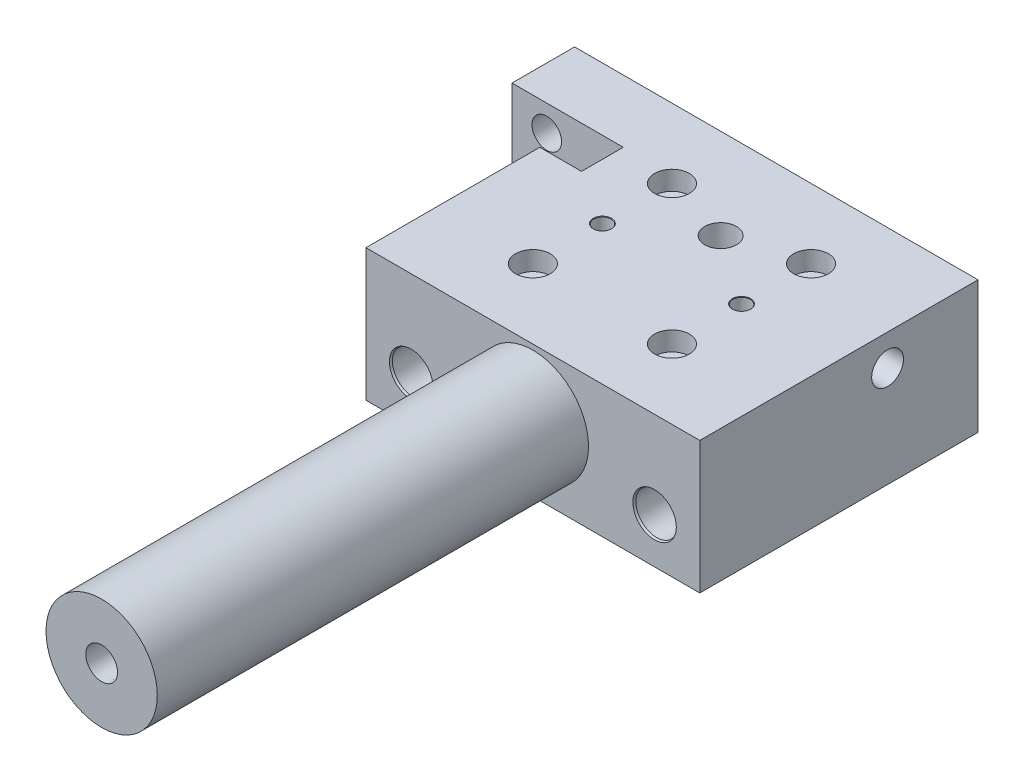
ISO-10303-21;
HEADER;
FILE_DESCRIPTION(('STEP AP214'),'2;1');
FILE_NAME('part.step','',(''),(''),'','','');
FILE_SCHEMA(('AUTOMOTIVE_DESIGN { 1 0 10303 214 1 1 1 1 }'));
ENDSEC;
DATA;
#1=APPLICATION_CONTEXT('core data for automotive mechanical design processes');
#2=APPLICATION_PROTOCOL_DEFINITION('international standard','automotive_design',2000,#1);
#3=PRODUCT_CONTEXT('',#1,'mechanical');
#4=PRODUCT('Part','Part','',(#3));
#5=PRODUCT_RELATED_PRODUCT_CATEGORY('part','',(#4));
#6=PRODUCT_DEFINITION_FORMATION('','',#4);
#7=PRODUCT_DEFINITION_CONTEXT('part definition',#1,'design');
#8=PRODUCT_DEFINITION('design','',#6,#7);
#9=PRODUCT_DEFINITION_SHAPE('','',#8);
#10=(LENGTH_UNIT() NAMED_UNIT(*) SI_UNIT(.MILLI.,.METRE.));
#11=(NAMED_UNIT(*) PLANE_ANGLE_UNIT() SI_UNIT($,.RADIAN.));
#12=(NAMED_UNIT(*) SI_UNIT($,.STERADIAN.) SOLID_ANGLE_UNIT());
#13=UNCERTAINTY_MEASURE_WITH_UNIT(LENGTH_MEASURE(1.E-05),#10,'distance_accuracy_value','');
#14=(GEOMETRIC_REPRESENTATION_CONTEXT(3) GLOBAL_UNCERTAINTY_ASSIGNED_CONTEXT((#13)) GLOBAL_UNIT_ASSIGNED_CONTEXT((#10,
#11,#12)) REPRESENTATION_CONTEXT('',''));
#15=CARTESIAN_POINT('',(0.,0.,0.));
#16=DIRECTION('',(0.,0.,1.));
#17=DIRECTION('',(1.,0.,0.));
#18=AXIS2_PLACEMENT_3D('',#15,#16,#17);
#19=CARTESIAN_POINT('',(0.,4.,-71.));
#20=DIRECTION('',(-1.,0.,0.));
#21=DIRECTION('',(0.,0.,1.));
#22=AXIS2_PLACEMENT_3D('',#19,#20,#21);
#23=CYLINDRICAL_SURFACE('',#22,2.39999999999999);
#24=CARTESIAN_POINT('',(8.99999999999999,4.,-71.));
#25=DIRECTION('',(-1.,0.,0.));
#26=DIRECTION('',(0.,0.,1.));
#27=AXIS2_PLACEMENT_3D('',#24,#25,#26);
#28=CIRCLE('',#27,2.39999999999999);
#29=CARTESIAN_POINT('',(8.99999999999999,4.,-68.6));
#30=VERTEX_POINT('',#29);
#31=EDGE_CURVE('E9355',#30,#30,#28,.T.);
#32=ORIENTED_EDGE('',*,*,#31,.F.);
#33=EDGE_LOOP('',(#32));
#34=FACE_BOUND('',#33,.T.);
#35=CARTESIAN_POINT('',(4.5,4.,-71.));
#36=DIRECTION('',(-1.,0.,0.));
#37=DIRECTION('',(0.,0.,1.));
#38=AXIS2_PLACEMENT_3D('',#35,#36,#37);
#39=CIRCLE('',#38,2.39999999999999);
#40=CARTESIAN_POINT('',(4.5,4.,-68.6));
#41=VERTEX_POINT('',#40);
#42=EDGE_CURVE('E9342',#41,#41,#39,.F.);
#43=ORIENTED_EDGE('',*,*,#42,.F.);
#44=EDGE_LOOP('',(#43));
#45=FACE_BOUND('',#44,.T.);
#46=ADVANCED_FACE('F9174',(#34,#45),#23,.F.);
#47=CARTESIAN_POINT('',(0.,38.,-80.));
#48=DIRECTION('',(1.,0.,0.));
#49=DIRECTION('',(0.,0.,-1.));
#50=AXIS2_PLACEMENT_3D('',#47,#48,#49);
#51=PLANE('',#50);
#52=CARTESIAN_POINT('',(0.,4.,-71.));
#53=DIRECTION('',(-1.,0.,0.));
#54=DIRECTION('',(0.,0.,1.));
#55=AXIS2_PLACEMENT_3D('',#52,#53,#54);
#56=CIRCLE('',#55,4.);
#57=CARTESIAN_POINT('',(0.,3.85832158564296,-67.0025098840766));
#58=VERTEX_POINT('',#57);
#59=CARTESIAN_POINT('',(0.,4.,-75.));
#60=VERTEX_POINT('',#59);
#61=EDGE_CURVE('E9321',#58,#60,#56,.T.);
#62=ORIENTED_EDGE('',*,*,#61,.F.);
#63=DIRECTION('',(0.,1.,0.));
#64=VECTOR('',#63,1.);
#65=CARTESIAN_POINT('',(0.,3.85832158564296,-67.0025098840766));
#66=LINE('',#65,#64);
#67=CARTESIAN_POINT('',(0.,0.,-67.0025098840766));
#68=VERTEX_POINT('',#67);
#69=EDGE_CURVE('E9328',#68,#58,#66,.T.);
#70=ORIENTED_EDGE('',*,*,#69,.F.);
#71=DIRECTION('',(0.,0.,1.));
#72=VECTOR('',#71,1.);
#73=CARTESIAN_POINT('',(0.,0.,-80.));
#74=LINE('',#73,#72);
#75=CARTESIAN_POINT('',(0.,0.,-62.));
#76=VERTEX_POINT('',#75);
#77=EDGE_CURVE('E9548',#68,#76,#74,.T.);
#78=ORIENTED_EDGE('',*,*,#77,.T.);
#79=DIRECTION('',(0.,-1.,0.));
#80=VECTOR('',#79,1.);
#81=CARTESIAN_POINT('',(0.,38.,-62.));
#82=LINE('',#81,#80);
#83=CARTESIAN_POINT('',(0.,38.,-62.));
#84=VERTEX_POINT('',#83);
#85=EDGE_CURVE('E9580',#84,#76,#82,.T.);
#86=ORIENTED_EDGE('',*,*,#85,.F.);
#87=DIRECTION('',(0.,0.,1.));
#88=VECTOR('',#87,1.);
#89=CARTESIAN_POINT('',(0.,38.,-80.));
#90=LINE('',#89,#88);
#91=CARTESIAN_POINT('',(0.,38.,-80.));
#92=VERTEX_POINT('',#91);
#93=EDGE_CURVE('E9565',#92,#84,#90,.T.);
#94=ORIENTED_EDGE('',*,*,#93,.F.);
#95=DIRECTION('',(0.,-1.,0.));
#96=VECTOR('',#95,1.);
#97=CARTESIAN_POINT('',(0.,38.,-80.));
#98=LINE('',#97,#96);
#99=CARTESIAN_POINT('',(0.,0.,-80.));
#100=VERTEX_POINT('',#99);
#101=EDGE_CURVE('E9583',#92,#100,#98,.T.);
#102=ORIENTED_EDGE('',*,*,#101,.T.);
#103=CARTESIAN_POINT('',(0.,0.,-75.));
#104=VERTEX_POINT('',#103);
#105=EDGE_CURVE('E9549',#100,#104,#74,.T.);
#106=ORIENTED_EDGE('',*,*,#105,.T.);
#107=DIRECTION('',(0.,-1.,0.));
#108=VECTOR('',#107,1.);
#109=CARTESIAN_POINT('',(0.,4.,-75.));
#110=LINE('',#109,#108);
#111=EDGE_CURVE('E9326',#60,#104,#110,.T.);
#112=ORIENTED_EDGE('',*,*,#111,.F.);
#113=EDGE_LOOP('',(#62,#70,#78,#86,#94,#102,#106,#112));
#114=FACE_BOUND('',#113,.T.);
#115=ADVANCED_FACE('F9645',(#114),#51,.F.);
#116=CARTESIAN_POINT('',(116.,0.,-80.));
#117=DIRECTION('',(0.,-1.,0.));
#118=DIRECTION('',(0.,0.,-1.));
#119=AXIS2_PLACEMENT_3D('',#116,#117,#118);
#120=PLANE('',#119);
#121=DIRECTION('',(-1.,0.,0.));
#122=VECTOR('',#121,1.);
#123=CARTESIAN_POINT('',(4.5,0.,-67.0025098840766));
#124=LINE('',#123,#122);
#125=CARTESIAN_POINT('',(4.5,0.,-67.0025098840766));
#126=VERTEX_POINT('',#125);
#127=EDGE_CURVE('E9343',#126,#68,#124,.T.);
#128=ORIENTED_EDGE('',*,*,#127,.F.);
#129=DIRECTION('',(0.,0.,1.));
#130=VECTOR('',#129,1.);
#131=CARTESIAN_POINT('',(4.5,0.,-75.));
#132=LINE('',#131,#130);
#133=CARTESIAN_POINT('',(4.5,0.,-75.));
#134=VERTEX_POINT('',#133);
#135=EDGE_CURVE('E9334',#134,#126,#132,.T.);
#136=ORIENTED_EDGE('',*,*,#135,.F.);
#137=DIRECTION('',(-1.,0.,0.));
#138=VECTOR('',#137,1.);
#139=CARTESIAN_POINT('',(4.5,0.,-75.));
#140=LINE('',#139,#138);
#141=EDGE_CURVE('E9345',#134,#104,#140,.T.);
#142=ORIENTED_EDGE('',*,*,#141,.T.);
#143=ORIENTED_EDGE('',*,*,#105,.F.);
#144=DIRECTION('',(-1.,0.,0.));
#145=VECTOR('',#144,1.);
#146=CARTESIAN_POINT('',(0.,0.,-80.));
#147=LINE('',#146,#145);
#148=CARTESIAN_POINT('',(8.99999999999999,0.,-80.));
#149=VERTEX_POINT('',#148);
#150=EDGE_CURVE('E9544',#149,#100,#147,.T.);
#151=ORIENTED_EDGE('',*,*,#150,.F.);
#152=DIRECTION('',(0.,0.,-1.));
#153=VECTOR('',#152,1.);
#154=CARTESIAN_POINT('',(8.99999999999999,0.,-61.));
#155=LINE('',#154,#153);
#156=CARTESIAN_POINT('',(8.99999999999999,0.,-62.));
#157=VERTEX_POINT('',#156);
#158=EDGE_CURVE('E9358',#157,#149,#155,.T.);
#159=ORIENTED_EDGE('',*,*,#158,.F.);
#160=DIRECTION('',(1.,0.,0.));
#161=VECTOR('',#160,1.);
#162=CARTESIAN_POINT('',(0.,0.,-62.));
#163=LINE('',#162,#161);
#164=EDGE_CURVE('E9553',#76,#157,#163,.T.);
#165=ORIENTED_EDGE('',*,*,#164,.F.);
#166=ORIENTED_EDGE('',*,*,#77,.F.);
#167=EDGE_LOOP('',(#128,#136,#142,#143,#151,#159,#165,#166));
#168=FACE_BOUND('',#167,.T.);
#169=ADVANCED_FACE('F9652',(#168),#120,.T.);
#170=CARTESIAN_POINT('',(20.,38.,0.));
#171=DIRECTION('',(0.,0.,-1.));
#172=DIRECTION('',(-1.,0.,0.));
#173=AXIS2_PLACEMENT_3D('',#170,#171,#172);
#174=PLANE('',#173);
#175=DIRECTION('',(1.,0.,0.));
#176=VECTOR('',#175,1.);
#177=CARTESIAN_POINT('',(20.,0.,0.));
#178=LINE('',#177,#176);
#179=CARTESIAN_POINT('',(20.,0.,0.));
#180=VERTEX_POINT('',#179);
#181=CARTESIAN_POINT('',(116.,0.,0.));
#182=VERTEX_POINT('',#181);
#183=EDGE_CURVE('E9558',#180,#182,#178,.T.);
#184=ORIENTED_EDGE('',*,*,#183,.T.);
#185=DIRECTION('',(0.,-1.,0.));
#186=VECTOR('',#185,1.);
#187=CARTESIAN_POINT('',(116.,38.,0.));
#188=LINE('',#187,#186);
#189=CARTESIAN_POINT('',(116.,38.,0.));
#190=VERTEX_POINT('',#189);
#191=EDGE_CURVE('E9572',#190,#182,#188,.T.);
#192=ORIENTED_EDGE('',*,*,#191,.F.);
#193=DIRECTION('',(1.,0.,0.));
#194=VECTOR('',#193,1.);
#195=CARTESIAN_POINT('',(20.,38.,0.));
#196=LINE('',#195,#194);
#197=CARTESIAN_POINT('',(20.,38.,0.));
#198=VERTEX_POINT('',#197);
#199=EDGE_CURVE('E9570',#198,#190,#196,.T.);
#200=ORIENTED_EDGE('',*,*,#199,.F.);
#201=DIRECTION('',(0.,-1.,0.));
#202=VECTOR('',#201,1.);
#203=CARTESIAN_POINT('',(20.,38.,0.));
#204=LINE('',#203,#202);
#205=EDGE_CURVE('E9575',#198,#180,#204,.T.);
#206=ORIENTED_EDGE('',*,*,#205,.T.);
#207=EDGE_LOOP('',(#184,#192,#200,#206));
#208=FACE_BOUND('',#207,.T.);
#209=CARTESIAN_POINT('',(33.,13.,0.));
#210=DIRECTION('',(0.,0.,1.));
#211=DIRECTION('',(1.,0.,0.));
#212=AXIS2_PLACEMENT_3D('',#209,#210,#211);
#213=CIRCLE('',#212,6.25);
#214=CARTESIAN_POINT('',(39.25,13.,0.));
#215=VERTEX_POINT('',#214);
#216=EDGE_CURVE('E9526',#215,#215,#213,.T.);
#217=ORIENTED_EDGE('',*,*,#216,.F.);
#218=EDGE_LOOP('',(#217));
#219=FACE_BOUND('',#218,.T.);
#220=CARTESIAN_POINT('',(103.,13.,0.));
#221=DIRECTION('',(0.,0.,1.));
#222=DIRECTION('',(1.,0.,0.));
#223=AXIS2_PLACEMENT_3D('',#220,#221,#222);
#224=CIRCLE('',#223,6.25000000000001);
#225=CARTESIAN_POINT('',(109.25,13.,0.));
#226=VERTEX_POINT('',#225);
#227=EDGE_CURVE('E9514',#226,#226,#224,.T.);
#228=ORIENTED_EDGE('',*,*,#227,.F.);
#229=EDGE_LOOP('',(#228));
#230=FACE_BOUND('',#229,.T.);
#231=CARTESIAN_POINT('',(68.,20.5,0.));
#232=DIRECTION('',(0.,0.,-1.));
#233=DIRECTION('',(-1.,0.,0.));
#234=AXIS2_PLACEMENT_3D('',#231,#232,#233);
#235=CIRCLE('',#234,16.);
#236=CARTESIAN_POINT('',(52.,20.5,0.));
#237=VERTEX_POINT('',#236);
#238=EDGE_CURVE('E9589',#237,#237,#235,.F.);
#239=ORIENTED_EDGE('',*,*,#238,.F.);
#240=EDGE_LOOP('',(#239));
#241=FACE_BOUND('',#240,.T.);
#242=ADVANCED_FACE('F9626',(#208,#219,#230,#241),#174,.F.);
#243=DIRECTION('',(0.,0.,1.));
#244=VECTOR('',#243,1.);
#245=CARTESIAN_POINT('',(11.,0.,-61.));
#246=LINE('',#245,#244);
#247=CARTESIAN_POINT('',(11.,0.,-80.));
#248=VERTEX_POINT('',#247);
#249=CARTESIAN_POINT('',(11.,0.,-62.));
#250=VERTEX_POINT('',#249);
#251=EDGE_CURVE('E9360',#248,#250,#246,.T.);
#252=ORIENTED_EDGE('',*,*,#251,.F.);
#253=CARTESIAN_POINT('',(116.,0.,-80.));
#254=VERTEX_POINT('',#253);
#255=EDGE_CURVE('E9545',#254,#248,#147,.T.);
#256=ORIENTED_EDGE('',*,*,#255,.F.);
#257=DIRECTION('',(0.,0.,-1.));
#258=VECTOR('',#257,1.);
#259=CARTESIAN_POINT('',(116.,0.,0.));
#260=LINE('',#259,#258);
#261=EDGE_CURVE('E9541',#182,#254,#260,.T.);
#262=ORIENTED_EDGE('',*,*,#261,.F.);
#263=ORIENTED_EDGE('',*,*,#183,.F.);
#264=DIRECTION('',(0.,0.,1.));
#265=VECTOR('',#264,1.);
#266=CARTESIAN_POINT('',(20.,0.,-62.));
#267=LINE('',#266,#265);
#268=CARTESIAN_POINT('',(20.,0.,-62.));
#269=VERTEX_POINT('',#268);
#270=EDGE_CURVE('E9556',#269,#180,#267,.T.);
#271=ORIENTED_EDGE('',*,*,#270,.F.);
#272=EDGE_CURVE('E9552',#250,#269,#163,.T.);
#273=ORIENTED_EDGE('',*,*,#272,.F.);
#274=EDGE_LOOP('',(#252,#256,#262,#263,#271,#273));
#275=FACE_BOUND('',#274,.T.);
#276=CARTESIAN_POINT('',(68.,0.,-54.));
#277=DIRECTION('',(0.,-1.,0.));
#278=DIRECTION('',(0.,0.,-1.));
#279=AXIS2_PLACEMENT_3D('',#276,#277,#278);
#280=CIRCLE('',#279,4.57349999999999);
#281=CARTESIAN_POINT('',(68.,0.,-58.5735));
#282=VERTEX_POINT('',#281);
#283=EDGE_CURVE('E9422',#282,#282,#280,.T.);
#284=ORIENTED_EDGE('',*,*,#283,.F.);
#285=EDGE_LOOP('',(#284));
#286=FACE_BOUND('',#285,.T.);
#287=CARTESIAN_POINT('',(48.,0.,-20.));
#288=DIRECTION('',(0.,-1.,0.));
#289=DIRECTION('',(0.,0.,-1.));
#290=AXIS2_PLACEMENT_3D('',#287,#288,#289);
#291=CIRCLE('',#290,5.);
#292=CARTESIAN_POINT('',(48.,0.,-25.));
#293=VERTEX_POINT('',#292);
#294=EDGE_CURVE('E9425',#293,#293,#291,.T.);
#295=ORIENTED_EDGE('',*,*,#294,.F.);
#296=EDGE_LOOP('',(#295));
#297=FACE_BOUND('',#296,.T.);
#298=CARTESIAN_POINT('',(48.,0.,-60.));
#299=DIRECTION('',(0.,-1.,0.));
#300=DIRECTION('',(0.,0.,-1.));
#301=AXIS2_PLACEMENT_3D('',#298,#299,#300);
#302=CIRCLE('',#301,5.);
#303=CARTESIAN_POINT('',(48.,0.,-65.));
#304=VERTEX_POINT('',#303);
#305=EDGE_CURVE('E9453',#304,#304,#302,.T.);
#306=ORIENTED_EDGE('',*,*,#305,.F.);
#307=EDGE_LOOP('',(#306));
#308=FACE_BOUND('',#307,.T.);
#309=CARTESIAN_POINT('',(88.,0.,-40.));
#310=DIRECTION('',(0.,-1.,0.));
#311=DIRECTION('',(0.,0.,-1.));
#312=AXIS2_PLACEMENT_3D('',#309,#310,#311);
#313=CIRCLE('',#312,2.625);
#314=CARTESIAN_POINT('',(88.,0.,-42.625));
#315=VERTEX_POINT('',#314);
#316=EDGE_CURVE('E9490',#315,#315,#313,.T.);
#317=ORIENTED_EDGE('',*,*,#316,.F.);
#318=EDGE_LOOP('',(#317));
#319=FACE_BOUND('',#318,.T.);
#320=CARTESIAN_POINT('',(48.,0.,-40.));
#321=DIRECTION('',(0.,-1.,0.));
#322=DIRECTION('',(0.,0.,-1.));
#323=AXIS2_PLACEMENT_3D('',#320,#321,#322);
#324=CIRCLE('',#323,2.625);
#325=CARTESIAN_POINT('',(48.,0.,-42.625));
#326=VERTEX_POINT('',#325);
#327=EDGE_CURVE('E9502',#326,#326,#324,.T.);
#328=ORIENTED_EDGE('',*,*,#327,.F.);
#329=EDGE_LOOP('',(#328));
#330=FACE_BOUND('',#329,.T.);
#331=CARTESIAN_POINT('',(88.,0.,-60.));
#332=DIRECTION('',(0.,-1.,0.));
#333=DIRECTION('',(0.,0.,-1.));
#334=AXIS2_PLACEMENT_3D('',#331,#332,#333);
#335=CIRCLE('',#334,5.);
#336=CARTESIAN_POINT('',(88.,0.,-65.));
#337=VERTEX_POINT('',#336);
#338=EDGE_CURVE('E9467',#337,#337,#335,.T.);
#339=ORIENTED_EDGE('',*,*,#338,.F.);
#340=EDGE_LOOP('',(#339));
#341=FACE_BOUND('',#340,.T.);
#342=CARTESIAN_POINT('',(88.,0.,-20.));
#343=DIRECTION('',(0.,-1.,0.));
#344=DIRECTION('',(0.,0.,-1.));
#345=AXIS2_PLACEMENT_3D('',#342,#343,#344);
#346=CIRCLE('',#345,5.);
#347=CARTESIAN_POINT('',(88.,0.,-25.));
#348=VERTEX_POINT('',#347);
#349=EDGE_CURVE('E9439',#348,#348,#346,.T.);
#350=ORIENTED_EDGE('',*,*,#349,.F.);
#351=EDGE_LOOP('',(#350));
#352=FACE_BOUND('',#351,.T.);
#353=ADVANCED_FACE('F9631',(#275,#286,#297,#308,#319,#330,#341,#352),#120,.T.);
#354=CARTESIAN_POINT('',(116.,38.,0.));
#355=DIRECTION('',(-1.,0.,0.));
#356=DIRECTION('',(0.,0.,1.));
#357=AXIS2_PLACEMENT_3D('',#354,#355,#356);
#358=PLANE('',#357);
#359=CARTESIAN_POINT('',(116.,29.,-54.));
#360=DIRECTION('',(1.,0.,0.));
#361=DIRECTION('',(0.,0.,-1.));
#362=AXIS2_PLACEMENT_3D('',#359,#360,#361);
#363=CIRCLE('',#362,4.5735);
#364=CARTESIAN_POINT('',(116.,29.,-58.5735));
#365=VERTEX_POINT('',#364);
#366=EDGE_CURVE('E9398',#365,#365,#363,.T.);
#367=ORIENTED_EDGE('',*,*,#366,.F.);
#368=EDGE_LOOP('',(#367));
#369=FACE_BOUND('',#368,.T.);
#370=ORIENTED_EDGE('',*,*,#261,.T.);
#371=DIRECTION('',(0.,-1.,0.));
#372=VECTOR('',#371,1.);
#373=CARTESIAN_POINT('',(116.,38.,-80.));
#374=LINE('',#373,#372);
#375=CARTESIAN_POINT('',(116.,38.,-80.));
#376=VERTEX_POINT('',#375);
#377=EDGE_CURVE('E9586',#376,#254,#374,.T.);
#378=ORIENTED_EDGE('',*,*,#377,.F.);
#379=DIRECTION('',(0.,0.,-1.));
#380=VECTOR('',#379,1.);
#381=CARTESIAN_POINT('',(116.,38.,0.));
#382=LINE('',#381,#380);
#383=EDGE_CURVE('E9560',#190,#376,#382,.T.);
#384=ORIENTED_EDGE('',*,*,#383,.F.);
#385=ORIENTED_EDGE('',*,*,#191,.T.);
#386=EDGE_LOOP('',(#370,#378,#384,#385));
#387=FACE_BOUND('',#386,.T.);
#388=ADVANCED_FACE('F9176',(#369,#387),#358,.F.);
#389=CARTESIAN_POINT('',(0.,38.,-80.));
#390=DIRECTION('',(0.,0.,1.));
#391=DIRECTION('',(1.,0.,0.));
#392=AXIS2_PLACEMENT_3D('',#389,#390,#391);
#393=PLANE('',#392);
#394=CARTESIAN_POINT('',(103.,13.,-80.));
#395=DIRECTION('',(0.,0.,1.));
#396=DIRECTION('',(1.,0.,0.));
#397=AXIS2_PLACEMENT_3D('',#394,#395,#396);
#398=CIRCLE('',#397,6.24999999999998);
#399=CARTESIAN_POINT('',(109.25,13.,-80.));
#400=VERTEX_POINT('',#399);
#401=EDGE_CURVE('E9505',#400,#400,#398,.T.);
#402=ORIENTED_EDGE('',*,*,#401,.T.);
#403=EDGE_LOOP('',(#402));
#404=FACE_BOUND('',#403,.T.);
#405=CARTESIAN_POINT('',(33.,13.,-80.));
#406=DIRECTION('',(0.,0.,1.));
#407=DIRECTION('',(1.,0.,0.));
#408=AXIS2_PLACEMENT_3D('',#405,#406,#407);
#409=CIRCLE('',#408,6.24999999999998);
#410=CARTESIAN_POINT('',(39.25,13.,-80.));
#411=VERTEX_POINT('',#410);
#412=EDGE_CURVE('E9517',#411,#411,#409,.T.);
#413=ORIENTED_EDGE('',*,*,#412,.T.);
#414=EDGE_LOOP('',(#413));
#415=FACE_BOUND('',#414,.T.);
#416=CARTESIAN_POINT('',(9.99999999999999,30.5,-80.));
#417=DIRECTION('',(0.,0.,1.));
#418=DIRECTION('',(1.,0.,0.));
#419=AXIS2_PLACEMENT_3D('',#416,#417,#418);
#420=CIRCLE('',#419,4.24999999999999);
#421=CARTESIAN_POINT('',(14.25,30.5,-80.));
#422=VERTEX_POINT('',#421);
#423=EDGE_CURVE('E9529',#422,#422,#420,.T.);
#424=ORIENTED_EDGE('',*,*,#423,.T.);
#425=EDGE_LOOP('',(#424));
#426=FACE_BOUND('',#425,.T.);
#427=CARTESIAN_POINT('',(9.99999999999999,13.5,-80.));
#428=DIRECTION('',(0.,0.,1.));
#429=DIRECTION('',(1.,0.,0.));
#430=AXIS2_PLACEMENT_3D('',#427,#428,#429);
#431=CIRCLE('',#430,6.);
#432=CARTESIAN_POINT('',(11.,7.58392021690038,-80.));
#433=VERTEX_POINT('',#432);
#434=CARTESIAN_POINT('',(8.99999999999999,7.58392021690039,-80.));
#435=VERTEX_POINT('',#434);
#436=EDGE_CURVE('E9535',#433,#435,#431,.T.);
#437=ORIENTED_EDGE('',*,*,#436,.T.);
#438=DIRECTION('',(0.,-1.,0.));
#439=VECTOR('',#438,1.);
#440=CARTESIAN_POINT('',(8.99999999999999,38.,-80.));
#441=LINE('',#440,#439);
#442=EDGE_CURVE('E9371',#435,#149,#441,.T.);
#443=ORIENTED_EDGE('',*,*,#442,.T.);
#444=ORIENTED_EDGE('',*,*,#150,.T.);
#445=ORIENTED_EDGE('',*,*,#101,.F.);
#446=DIRECTION('',(-1.,0.,0.));
#447=VECTOR('',#446,1.);
#448=CARTESIAN_POINT('',(0.,38.,-80.));
#449=LINE('',#448,#447);
#450=EDGE_CURVE('E9563',#376,#92,#449,.T.);
#451=ORIENTED_EDGE('',*,*,#450,.F.);
#452=ORIENTED_EDGE('',*,*,#377,.T.);
#453=ORIENTED_EDGE('',*,*,#255,.T.);
#454=DIRECTION('',(0.,1.,0.));
#455=VECTOR('',#454,1.);
#456=CARTESIAN_POINT('',(11.,38.,-80.));
#457=LINE('',#456,#455);
#458=EDGE_CURVE('E9365',#248,#433,#457,.T.);
#459=ORIENTED_EDGE('',*,*,#458,.T.);
#460=EDGE_LOOP('',(#437,#443,#444,#445,#451,#452,#453,#459));
#461=FACE_BOUND('',#460,.T.);
#462=ADVANCED_FACE('F9640',(#404,#415,#426,#461),#393,.F.);
#463=CARTESIAN_POINT('',(0.,38.,-62.));
#464=DIRECTION('',(0.,0.,-1.));
#465=DIRECTION('',(-1.,0.,0.));
#466=AXIS2_PLACEMENT_3D('',#463,#464,#465);
#467=PLANE('',#466);
#468=CARTESIAN_POINT('',(9.99999999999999,30.5,-62.));
#469=DIRECTION('',(0.,0.,1.));
#470=DIRECTION('',(1.,0.,0.));
#471=AXIS2_PLACEMENT_3D('',#468,#469,#470);
#472=CIRCLE('',#471,4.24999999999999);
#473=CARTESIAN_POINT('',(14.25,30.5,-62.));
#474=VERTEX_POINT('',#473);
#475=EDGE_CURVE('E9532',#474,#474,#472,.T.);
#476=ORIENTED_EDGE('',*,*,#475,.F.);
#477=EDGE_LOOP('',(#476));
#478=FACE_BOUND('',#477,.T.);
#479=DIRECTION('',(0.,-1.,0.));
#480=VECTOR('',#479,1.);
#481=CARTESIAN_POINT('',(20.,38.,-62.));
#482=LINE('',#481,#480);
#483=CARTESIAN_POINT('',(20.,26.,-62.));
#484=VERTEX_POINT('',#483);
#485=EDGE_CURVE('E9578',#484,#269,#482,.T.);
#486=ORIENTED_EDGE('',*,*,#485,.F.);
#487=DIRECTION('',(-0.707106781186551,-0.707106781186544,0.));
#488=VECTOR('',#487,1.);
#489=CARTESIAN_POINT('',(19.9999999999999,26.,-62.));
#490=LINE('',#489,#488);
#491=CARTESIAN_POINT('',(32.,38.,-62.));
#492=VERTEX_POINT('',#491);
#493=EDGE_CURVE('E9182',#484,#492,#490,.F.);
#494=ORIENTED_EDGE('',*,*,#493,.T.);
#495=DIRECTION('',(1.,0.,0.));
#496=VECTOR('',#495,1.);
#497=CARTESIAN_POINT('',(0.,38.,-62.));
#498=LINE('',#497,#496);
#499=EDGE_CURVE('E9311',#84,#492,#498,.T.);
#500=ORIENTED_EDGE('',*,*,#499,.F.);
#501=ORIENTED_EDGE('',*,*,#85,.T.);
#502=ORIENTED_EDGE('',*,*,#164,.T.);
#503=DIRECTION('',(0.,1.,0.));
#504=VECTOR('',#503,1.);
#505=CARTESIAN_POINT('',(8.99999999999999,38.,-62.));
#506=LINE('',#505,#504);
#507=CARTESIAN_POINT('',(8.99999999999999,7.58392021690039,-62.));
#508=VERTEX_POINT('',#507);
#509=EDGE_CURVE('E9368',#157,#508,#506,.T.);
#510=ORIENTED_EDGE('',*,*,#509,.T.);
#511=CARTESIAN_POINT('',(9.99999999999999,13.5,-62.));
#512=DIRECTION('',(0.,0.,1.));
#513=DIRECTION('',(1.,0.,0.));
#514=AXIS2_PLACEMENT_3D('',#511,#512,#513);
#515=CIRCLE('',#514,6.);
#516=CARTESIAN_POINT('',(11.,7.58392021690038,-62.));
#517=VERTEX_POINT('',#516);
#518=EDGE_CURVE('E9538',#517,#508,#515,.T.);
#519=ORIENTED_EDGE('',*,*,#518,.F.);
#520=DIRECTION('',(0.,-1.,0.));
#521=VECTOR('',#520,1.);
#522=CARTESIAN_POINT('',(11.,38.,-62.));
#523=LINE('',#522,#521);
#524=EDGE_CURVE('E9362',#517,#250,#523,.T.);
#525=ORIENTED_EDGE('',*,*,#524,.T.);
#526=ORIENTED_EDGE('',*,*,#272,.T.);
#527=EDGE_LOOP('',(#486,#494,#500,#501,#502,#510,#519,#525,#526));
#528=FACE_BOUND('',#527,.T.);
#529=ADVANCED_FACE('F9616',(#478,#528),#467,.F.);
#530=CARTESIAN_POINT('',(20.,38.,-62.));
#531=DIRECTION('',(1.,0.,0.));
#532=DIRECTION('',(0.,0.,-1.));
#533=AXIS2_PLACEMENT_3D('',#530,#531,#532);
#534=PLANE('',#533);
#535=DIRECTION('',(0.,0.,1.));
#536=VECTOR('',#535,1.);
#537=CARTESIAN_POINT('',(20.,38.,-62.));
#538=LINE('',#537,#536);
#539=CARTESIAN_POINT('',(20.,38.,-50.));
#540=VERTEX_POINT('',#539);
#541=EDGE_CURVE('E9568',#540,#198,#538,.T.);
#542=ORIENTED_EDGE('',*,*,#541,.F.);
#543=DIRECTION('',(0.,1.,0.));
#544=VECTOR('',#543,1.);
#545=CARTESIAN_POINT('',(20.,26.,-50.));
#546=LINE('',#545,#544);
#547=CARTESIAN_POINT('',(20.,26.,-50.));
#548=VERTEX_POINT('',#547);
#549=EDGE_CURVE('E9188',#548,#540,#546,.T.);
#550=ORIENTED_EDGE('',*,*,#549,.F.);
#551=DIRECTION('',(0.,0.,1.));
#552=VECTOR('',#551,1.);
#553=CARTESIAN_POINT('',(20.,26.,-50.));
#554=LINE('',#553,#552);
#555=EDGE_CURVE('E9313',#484,#548,#554,.T.);
#556=ORIENTED_EDGE('',*,*,#555,.F.);
#557=ORIENTED_EDGE('',*,*,#485,.T.);
#558=ORIENTED_EDGE('',*,*,#270,.T.);
#559=ORIENTED_EDGE('',*,*,#205,.F.);
#560=EDGE_LOOP('',(#542,#550,#556,#557,#558,#559));
#561=FACE_BOUND('',#560,.T.);
#562=ADVANCED_FACE('F9620',(#561),#534,.F.);
#563=CARTESIAN_POINT('',(116.,38.,-80.));
#564=DIRECTION('',(0.,-1.,0.));
#565=DIRECTION('',(0.,0.,-1.));
#566=AXIS2_PLACEMENT_3D('',#563,#564,#565);
#567=PLANE('',#566);
#568=CARTESIAN_POINT('',(68.,38.,-54.));
#569=DIRECTION('',(0.,1.,0.));
#570=DIRECTION('',(0.,0.,1.));
#571=AXIS2_PLACEMENT_3D('',#568,#569,#570);
#572=CIRCLE('',#571,4.57349999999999);
#573=CARTESIAN_POINT('',(68.,38.,-49.4265));
#574=VERTEX_POINT('',#573);
#575=EDGE_CURVE('E9401',#574,#574,#572,.T.);
#576=ORIENTED_EDGE('',*,*,#575,.F.);
#577=EDGE_LOOP('',(#576));
#578=FACE_BOUND('',#577,.T.);
#579=CARTESIAN_POINT('',(48.,38.,-20.));
#580=DIRECTION('',(0.,1.,0.));
#581=DIRECTION('',(0.,0.,1.));
#582=AXIS2_PLACEMENT_3D('',#579,#580,#581);
#583=CIRCLE('',#582,5.);
#584=CARTESIAN_POINT('',(48.,38.,-15.));
#585=VERTEX_POINT('',#584);
#586=EDGE_CURVE('E9432',#585,#585,#583,.T.);
#587=ORIENTED_EDGE('',*,*,#586,.F.);
#588=EDGE_LOOP('',(#587));
#589=FACE_BOUND('',#588,.T.);
#590=CARTESIAN_POINT('',(88.,38.,-20.));
#591=DIRECTION('',(0.,1.,0.));
#592=DIRECTION('',(0.,0.,1.));
#593=AXIS2_PLACEMENT_3D('',#590,#591,#592);
#594=CIRCLE('',#593,5.);
#595=CARTESIAN_POINT('',(88.,38.,-15.));
#596=VERTEX_POINT('',#595);
#597=EDGE_CURVE('E9446',#596,#596,#594,.T.);
#598=ORIENTED_EDGE('',*,*,#597,.F.);
#599=EDGE_LOOP('',(#598));
#600=FACE_BOUND('',#599,.T.);
#601=CARTESIAN_POINT('',(48.,38.,-60.));
#602=DIRECTION('',(0.,1.,0.));
#603=DIRECTION('',(0.,0.,1.));
#604=AXIS2_PLACEMENT_3D('',#601,#602,#603);
#605=CIRCLE('',#604,5.);
#606=CARTESIAN_POINT('',(48.,38.,-55.));
#607=VERTEX_POINT('',#606);
#608=EDGE_CURVE('E9460',#607,#607,#605,.T.);
#609=ORIENTED_EDGE('',*,*,#608,.F.);
#610=EDGE_LOOP('',(#609));
#611=FACE_BOUND('',#610,.T.);
#612=CARTESIAN_POINT('',(88.,38.,-60.));
#613=DIRECTION('',(0.,1.,0.));
#614=DIRECTION('',(0.,0.,1.));
#615=AXIS2_PLACEMENT_3D('',#612,#613,#614);
#616=CIRCLE('',#615,5.);
#617=CARTESIAN_POINT('',(88.,38.,-55.));
#618=VERTEX_POINT('',#617);
#619=EDGE_CURVE('E9477',#618,#618,#616,.T.);
#620=ORIENTED_EDGE('',*,*,#619,.F.);
#621=EDGE_LOOP('',(#620));
#622=FACE_BOUND('',#621,.T.);
#623=CARTESIAN_POINT('',(88.,38.,-40.));
#624=DIRECTION('',(0.,-1.,0.));
#625=DIRECTION('',(0.,0.,-1.));
#626=AXIS2_PLACEMENT_3D('',#623,#624,#625);
#627=CIRCLE('',#626,2.62499999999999);
#628=CARTESIAN_POINT('',(88.,38.,-42.625));
#629=VERTEX_POINT('',#628);
#630=EDGE_CURVE('E9481',#629,#629,#627,.T.);
#631=ORIENTED_EDGE('',*,*,#630,.T.);
#632=EDGE_LOOP('',(#631));
#633=FACE_BOUND('',#632,.T.);
#634=CARTESIAN_POINT('',(48.,38.,-40.));
#635=DIRECTION('',(0.,-1.,0.));
#636=DIRECTION('',(0.,0.,-1.));
#637=AXIS2_PLACEMENT_3D('',#634,#635,#636);
#638=CIRCLE('',#637,2.62499999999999);
#639=CARTESIAN_POINT('',(48.,38.,-42.625));
#640=VERTEX_POINT('',#639);
#641=EDGE_CURVE('E9493',#640,#640,#638,.T.);
#642=ORIENTED_EDGE('',*,*,#641,.T.);
#643=EDGE_LOOP('',(#642));
#644=FACE_BOUND('',#643,.T.);
#645=ORIENTED_EDGE('',*,*,#499,.T.);
#646=DIRECTION('',(0.,0.,-1.));
#647=VECTOR('',#646,1.);
#648=CARTESIAN_POINT('',(32.,38.,-62.));
#649=LINE('',#648,#647);
#650=CARTESIAN_POINT('',(32.,38.,-50.));
#651=VERTEX_POINT('',#650);
#652=EDGE_CURVE('E9305',#651,#492,#649,.T.);
#653=ORIENTED_EDGE('',*,*,#652,.F.);
#654=DIRECTION('',(1.,0.,0.));
#655=VECTOR('',#654,1.);
#656=CARTESIAN_POINT('',(32.,38.,-50.));
#657=LINE('',#656,#655);
#658=EDGE_CURVE('E9299',#540,#651,#657,.T.);
#659=ORIENTED_EDGE('',*,*,#658,.F.);
#660=ORIENTED_EDGE('',*,*,#541,.T.);
#661=ORIENTED_EDGE('',*,*,#199,.T.);
#662=ORIENTED_EDGE('',*,*,#383,.T.);
#663=ORIENTED_EDGE('',*,*,#450,.T.);
#664=ORIENTED_EDGE('',*,*,#93,.T.);
#665=EDGE_LOOP('',(#645,#653,#659,#660,#661,#662,#663,#664));
#666=FACE_BOUND('',#665,.T.);
#667=ADVANCED_FACE('F9309',(#578,#589,#600,#611,#622,#633,#644,#666),#567,.F.);
#668=CARTESIAN_POINT('',(9.99999999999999,13.5,-62.));
#669=DIRECTION('',(0.,0.,1.));
#670=DIRECTION('',(1.,0.,0.));
#671=AXIS2_PLACEMENT_3D('',#668,#669,#670);
#672=CYLINDRICAL_SURFACE('',#671,6.);
#673=ORIENTED_EDGE('',*,*,#518,.T.);
#674=DIRECTION('',(0.,0.,1.));
#675=VECTOR('',#674,1.);
#676=CARTESIAN_POINT('',(8.99999999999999,7.58392021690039,-62.));
#677=LINE('',#676,#675);
#678=EDGE_CURVE('E9611',#508,#435,#677,.F.);
#679=ORIENTED_EDGE('',*,*,#678,.T.);
#680=ORIENTED_EDGE('',*,*,#436,.F.);
#681=DIRECTION('',(0.,0.,1.));
#682=VECTOR('',#681,1.);
#683=CARTESIAN_POINT('',(11.,7.58392021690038,-62.));
#684=LINE('',#683,#682);
#685=EDGE_CURVE('E9608',#433,#517,#684,.T.);
#686=ORIENTED_EDGE('',*,*,#685,.T.);
#687=EDGE_LOOP('',(#673,#679,#680,#686));
#688=FACE_BOUND('',#687,.T.);
#689=ADVANCED_FACE('F9657',(#688),#672,.F.);
#690=CARTESIAN_POINT('',(9.99999999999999,30.5,-62.));
#691=DIRECTION('',(0.,0.,1.));
#692=DIRECTION('',(1.,0.,0.));
#693=AXIS2_PLACEMENT_3D('',#690,#691,#692);
#694=CYLINDRICAL_SURFACE('',#693,4.24999999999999);
#695=ORIENTED_EDGE('',*,*,#423,.F.);
#696=EDGE_LOOP('',(#695));
#697=FACE_BOUND('',#696,.T.);
#698=ORIENTED_EDGE('',*,*,#475,.T.);
#699=EDGE_LOOP('',(#698));
#700=FACE_BOUND('',#699,.T.);
#701=ADVANCED_FACE('F9789',(#697,#700),#694,.F.);
#702=CARTESIAN_POINT('',(33.,13.,0.));
#703=DIRECTION('',(0.,0.,1.));
#704=DIRECTION('',(1.,0.,0.));
#705=AXIS2_PLACEMENT_3D('',#702,#703,#704);
#706=CONICAL_SURFACE('',#705,6.25,0.392699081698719);
#707=CARTESIAN_POINT('',(33.,13.,-0.6035533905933));
#708=DIRECTION('',(0.,0.,1.));
#709=DIRECTION('',(1.,0.,0.));
#710=AXIS2_PLACEMENT_3D('',#707,#708,#709);
#711=CIRCLE('',#710,5.99999999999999);
#712=CARTESIAN_POINT('',(39.,13.,-0.6035533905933));
#713=VERTEX_POINT('',#712);
#714=EDGE_CURVE('E9523',#713,#713,#711,.T.);
#715=ORIENTED_EDGE('',*,*,#714,.F.);
#716=EDGE_LOOP('',(#715));
#717=FACE_BOUND('',#716,.T.);
#718=ORIENTED_EDGE('',*,*,#216,.T.);
#719=EDGE_LOOP('',(#718));
#720=FACE_BOUND('',#719,.T.);
#721=ADVANCED_FACE('F10199',(#717,#720),#706,.F.);
#722=CARTESIAN_POINT('',(33.,13.,0.));
#723=DIRECTION('',(0.,0.,1.));
#724=DIRECTION('',(1.,0.,0.));
#725=AXIS2_PLACEMENT_3D('',#722,#723,#724);
#726=CYLINDRICAL_SURFACE('',#725,5.99999999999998);
#727=CARTESIAN_POINT('',(33.,13.,-79.3964466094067));
#728=DIRECTION('',(0.,0.,1.));
#729=DIRECTION('',(1.,0.,0.));
#730=AXIS2_PLACEMENT_3D('',#727,#728,#729);
#731=CIRCLE('',#730,5.99999999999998);
#732=CARTESIAN_POINT('',(39.,13.,-79.3964466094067));
#733=VERTEX_POINT('',#732);
#734=EDGE_CURVE('E9520',#733,#733,#731,.T.);
#735=ORIENTED_EDGE('',*,*,#734,.F.);
#736=EDGE_LOOP('',(#735));
#737=FACE_BOUND('',#736,.T.);
#738=ORIENTED_EDGE('',*,*,#714,.T.);
#739=EDGE_LOOP('',(#738));
#740=FACE_BOUND('',#739,.T.);
#741=ADVANCED_FACE('F10191',(#737,#740),#726,.F.);
#742=CARTESIAN_POINT('',(33.,13.,-79.3964466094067));
#743=DIRECTION('',(0.,0.,-1.));
#744=DIRECTION('',(-1.,0.,0.));
#745=AXIS2_PLACEMENT_3D('',#742,#743,#744);
#746=CONICAL_SURFACE('',#745,5.99999999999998,0.392699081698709);
#747=ORIENTED_EDGE('',*,*,#412,.F.);
#748=EDGE_LOOP('',(#747));
#749=FACE_BOUND('',#748,.T.);
#750=ORIENTED_EDGE('',*,*,#734,.T.);
#751=EDGE_LOOP('',(#750));
#752=FACE_BOUND('',#751,.T.);
#753=ADVANCED_FACE('F10183',(#749,#752),#746,.F.);
#754=CARTESIAN_POINT('',(103.,13.,0.));
#755=DIRECTION('',(0.,0.,1.));
#756=DIRECTION('',(1.,0.,0.));
#757=AXIS2_PLACEMENT_3D('',#754,#755,#756);
#758=CONICAL_SURFACE('',#757,6.25000000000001,0.392699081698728);
#759=CARTESIAN_POINT('',(103.,13.,-0.6035533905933));
#760=DIRECTION('',(0.,0.,1.));
#761=DIRECTION('',(1.,0.,0.));
#762=AXIS2_PLACEMENT_3D('',#759,#760,#761);
#763=CIRCLE('',#762,5.99999999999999);
#764=CARTESIAN_POINT('',(109.,13.,-0.6035533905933));
#765=VERTEX_POINT('',#764);
#766=EDGE_CURVE('E9511',#765,#765,#763,.T.);
#767=ORIENTED_EDGE('',*,*,#766,.F.);
#768=EDGE_LOOP('',(#767));
#769=FACE_BOUND('',#768,.T.);
#770=ORIENTED_EDGE('',*,*,#227,.T.);
#771=EDGE_LOOP('',(#770));
#772=FACE_BOUND('',#771,.T.);
#773=ADVANCED_FACE('F10175',(#769,#772),#758,.F.);
#774=CARTESIAN_POINT('',(103.,13.,0.));
#775=DIRECTION('',(0.,0.,1.));
#776=DIRECTION('',(1.,0.,0.));
#777=AXIS2_PLACEMENT_3D('',#774,#775,#776);
#778=CYLINDRICAL_SURFACE('',#777,5.99999999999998);
#779=CARTESIAN_POINT('',(103.,13.,-79.3964466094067));
#780=DIRECTION('',(0.,0.,1.));
#781=DIRECTION('',(1.,0.,0.));
#782=AXIS2_PLACEMENT_3D('',#779,#780,#781);
#783=CIRCLE('',#782,5.99999999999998);
#784=CARTESIAN_POINT('',(109.,13.,-79.3964466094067));
#785=VERTEX_POINT('',#784);
#786=EDGE_CURVE('E9508',#785,#785,#783,.T.);
#787=ORIENTED_EDGE('',*,*,#786,.F.);
#788=EDGE_LOOP('',(#787));
#789=FACE_BOUND('',#788,.T.);
#790=ORIENTED_EDGE('',*,*,#766,.T.);
#791=EDGE_LOOP('',(#790));
#792=FACE_BOUND('',#791,.T.);
#793=ADVANCED_FACE('F10167',(#789,#792),#778,.F.);
#794=CARTESIAN_POINT('',(103.,13.,-79.3964466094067));
#795=DIRECTION('',(0.,0.,-1.));
#796=DIRECTION('',(-1.,0.,0.));
#797=AXIS2_PLACEMENT_3D('',#794,#795,#796);
#798=CONICAL_SURFACE('',#797,5.99999999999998,0.392699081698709);
#799=ORIENTED_EDGE('',*,*,#401,.F.);
#800=EDGE_LOOP('',(#799));
#801=FACE_BOUND('',#800,.T.);
#802=ORIENTED_EDGE('',*,*,#786,.T.);
#803=EDGE_LOOP('',(#802));
#804=FACE_BOUND('',#803,.T.);
#805=ADVANCED_FACE('F10159',(#801,#804),#798,.F.);
#806=CARTESIAN_POINT('',(48.,0.,-40.));
#807=DIRECTION('',(0.,-1.,0.));
#808=DIRECTION('',(0.,0.,-1.));
#809=AXIS2_PLACEMENT_3D('',#806,#807,#808);
#810=CONICAL_SURFACE('',#809,2.625,0.785398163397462);
#811=CARTESIAN_POINT('',(48.,0.125000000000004,-40.));
#812=DIRECTION('',(0.,-1.,0.));
#813=DIRECTION('',(0.,0.,-1.));
#814=AXIS2_PLACEMENT_3D('',#811,#812,#813);
#815=CIRCLE('',#814,2.5);
#816=CARTESIAN_POINT('',(48.,0.125000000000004,-42.5));
#817=VERTEX_POINT('',#816);
#818=EDGE_CURVE('E9499',#817,#817,#815,.T.);
#819=ORIENTED_EDGE('',*,*,#818,.F.);
#820=EDGE_LOOP('',(#819));
#821=FACE_BOUND('',#820,.T.);
#822=ORIENTED_EDGE('',*,*,#327,.T.);
#823=EDGE_LOOP('',(#822));
#824=FACE_BOUND('',#823,.T.);
#825=ADVANCED_FACE('F10151',(#821,#824),#810,.F.);
#826=CARTESIAN_POINT('',(48.,0.,-40.));
#827=DIRECTION('',(0.,-1.,0.));
#828=DIRECTION('',(0.,0.,-1.));
#829=AXIS2_PLACEMENT_3D('',#826,#827,#828);
#830=CYLINDRICAL_SURFACE('',#829,2.5);
#831=CARTESIAN_POINT('',(48.,37.875,-40.));
#832=DIRECTION('',(0.,-1.,0.));
#833=DIRECTION('',(0.,0.,-1.));
#834=AXIS2_PLACEMENT_3D('',#831,#832,#833);
#835=CIRCLE('',#834,2.5);
#836=CARTESIAN_POINT('',(48.,37.875,-42.5));
#837=VERTEX_POINT('',#836);
#838=EDGE_CURVE('E9496',#837,#837,#835,.T.);
#839=ORIENTED_EDGE('',*,*,#838,.F.);
#840=EDGE_LOOP('',(#839));
#841=FACE_BOUND('',#840,.T.);
#842=ORIENTED_EDGE('',*,*,#818,.T.);
#843=EDGE_LOOP('',(#842));
#844=FACE_BOUND('',#843,.T.);
#845=ADVANCED_FACE('F10143',(#841,#844),#830,.F.);
#846=CARTESIAN_POINT('',(48.,37.875,-40.));
#847=DIRECTION('',(0.,1.,0.));
#848=DIRECTION('',(0.,0.,1.));
#849=AXIS2_PLACEMENT_3D('',#846,#847,#848);
#850=CONICAL_SURFACE('',#849,2.5,0.785398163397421);
#851=ORIENTED_EDGE('',*,*,#641,.F.);
#852=EDGE_LOOP('',(#851));
#853=FACE_BOUND('',#852,.T.);
#854=ORIENTED_EDGE('',*,*,#838,.T.);
#855=EDGE_LOOP('',(#854));
#856=FACE_BOUND('',#855,.T.);
#857=ADVANCED_FACE('F10135',(#853,#856),#850,.F.);
#858=CARTESIAN_POINT('',(88.,0.,-40.));
#859=DIRECTION('',(0.,-1.,0.));
#860=DIRECTION('',(0.,0.,-1.));
#861=AXIS2_PLACEMENT_3D('',#858,#859,#860);
#862=CONICAL_SURFACE('',#861,2.625,0.785398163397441);
#863=CARTESIAN_POINT('',(88.,0.125000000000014,-40.));
#864=DIRECTION('',(0.,-1.,0.));
#865=DIRECTION('',(0.,0.,-1.));
#866=AXIS2_PLACEMENT_3D('',#863,#864,#865);
#867=CIRCLE('',#866,2.49999999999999);
#868=CARTESIAN_POINT('',(88.,0.125000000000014,-42.5));
#869=VERTEX_POINT('',#868);
#870=EDGE_CURVE('E9487',#869,#869,#867,.T.);
#871=ORIENTED_EDGE('',*,*,#870,.F.);
#872=EDGE_LOOP('',(#871));
#873=FACE_BOUND('',#872,.T.);
#874=ORIENTED_EDGE('',*,*,#316,.T.);
#875=EDGE_LOOP('',(#874));
#876=FACE_BOUND('',#875,.T.);
#877=ADVANCED_FACE('F10127',(#873,#876),#862,.F.);
#878=CARTESIAN_POINT('',(88.,0.,-40.));
#879=DIRECTION('',(0.,-1.,0.));
#880=DIRECTION('',(0.,0.,-1.));
#881=AXIS2_PLACEMENT_3D('',#878,#879,#880);
#882=CYLINDRICAL_SURFACE('',#881,2.49999999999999);
#883=CARTESIAN_POINT('',(88.,37.875,-40.));
#884=DIRECTION('',(0.,-1.,0.));
#885=DIRECTION('',(0.,0.,-1.));
#886=AXIS2_PLACEMENT_3D('',#883,#884,#885);
#887=CIRCLE('',#886,2.49999999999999);
#888=CARTESIAN_POINT('',(88.,37.875,-42.5));
#889=VERTEX_POINT('',#888);
#890=EDGE_CURVE('E9484',#889,#889,#887,.T.);
#891=ORIENTED_EDGE('',*,*,#890,.F.);
#892=EDGE_LOOP('',(#891));
#893=FACE_BOUND('',#892,.T.);
#894=ORIENTED_EDGE('',*,*,#870,.T.);
#895=EDGE_LOOP('',(#894));
#896=FACE_BOUND('',#895,.T.);
#897=ADVANCED_FACE('F10119',(#893,#896),#882,.F.);
#898=CARTESIAN_POINT('',(88.,37.875,-40.));
#899=DIRECTION('',(0.,1.,0.));
#900=DIRECTION('',(0.,0.,1.));
#901=AXIS2_PLACEMENT_3D('',#898,#899,#900);
#902=CONICAL_SURFACE('',#901,2.49999999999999,0.785398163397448);
#903=ORIENTED_EDGE('',*,*,#630,.F.);
#904=EDGE_LOOP('',(#903));
#905=FACE_BOUND('',#904,.T.);
#906=ORIENTED_EDGE('',*,*,#890,.T.);
#907=EDGE_LOOP('',(#906));
#908=FACE_BOUND('',#907,.T.);
#909=ADVANCED_FACE('F10098',(#905,#908),#902,.F.);
#910=CARTESIAN_POINT('',(88.,38.,-60.));
#911=DIRECTION('',(0.,1.,0.));
#912=DIRECTION('',(0.,0.,1.));
#913=AXIS2_PLACEMENT_3D('',#910,#911,#912);
#914=CYLINDRICAL_SURFACE('',#913,2.49999999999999);
#915=CARTESIAN_POINT('',(88.,5.50000000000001,-60.));
#916=DIRECTION('',(0.,1.,0.));
#917=DIRECTION('',(0.,0.,1.));
#918=AXIS2_PLACEMENT_3D('',#915,#916,#917);
#919=CIRCLE('',#918,2.49999999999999);
#920=CARTESIAN_POINT('',(88.,5.50000000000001,-57.5));
#921=VERTEX_POINT('',#920);
#922=EDGE_CURVE('E9473',#921,#921,#919,.F.);
#923=ORIENTED_EDGE('',*,*,#922,.T.);
#924=EDGE_LOOP('',(#923));
#925=FACE_BOUND('',#924,.T.);
#926=CARTESIAN_POINT('',(88.,32.5,-60.));
#927=DIRECTION('',(0.,-1.,0.));
#928=DIRECTION('',(0.,0.,-1.));
#929=AXIS2_PLACEMENT_3D('',#926,#927,#928);
#930=CIRCLE('',#929,2.49999999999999);
#931=CARTESIAN_POINT('',(88.,32.5,-62.5));
#932=VERTEX_POINT('',#931);
#933=EDGE_CURVE('E9480',#932,#932,#930,.F.);
#934=ORIENTED_EDGE('',*,*,#933,.T.);
#935=EDGE_LOOP('',(#934));
#936=FACE_BOUND('',#935,.T.);
#937=ADVANCED_FACE('F10093',(#925,#936),#914,.F.);
#938=CARTESIAN_POINT('',(88.,32.5,-60.));
#939=DIRECTION('',(0.,-1.,0.));
#940=DIRECTION('',(0.,0.,-1.));
#941=AXIS2_PLACEMENT_3D('',#938,#939,#940);
#942=PLANE('',#941);
#943=CARTESIAN_POINT('',(88.,32.5,-60.));
#944=DIRECTION('',(0.,1.,0.));
#945=DIRECTION('',(0.,0.,1.));
#946=AXIS2_PLACEMENT_3D('',#943,#944,#945);
#947=CIRCLE('',#946,5.);
#948=CARTESIAN_POINT('',(88.,32.5,-55.));
#949=VERTEX_POINT('',#948);
#950=EDGE_CURVE('E9474',#949,#949,#947,.T.);
#951=ORIENTED_EDGE('',*,*,#950,.T.);
#952=EDGE_LOOP('',(#951));
#953=FACE_BOUND('',#952,.T.);
#954=ORIENTED_EDGE('',*,*,#933,.F.);
#955=EDGE_LOOP('',(#954));
#956=FACE_BOUND('',#955,.T.);
#957=ADVANCED_FACE('F10097',(#953,#956),#942,.F.);
#958=CARTESIAN_POINT('',(88.,38.,-60.));
#959=DIRECTION('',(0.,1.,0.));
#960=DIRECTION('',(0.,0.,1.));
#961=AXIS2_PLACEMENT_3D('',#958,#959,#960);
#962=CYLINDRICAL_SURFACE('',#961,5.);
#963=ORIENTED_EDGE('',*,*,#950,.F.);
#964=EDGE_LOOP('',(#963));
#965=FACE_BOUND('',#964,.T.);
#966=ORIENTED_EDGE('',*,*,#619,.T.);
#967=EDGE_LOOP('',(#966));
#968=FACE_BOUND('',#967,.T.);
#969=ADVANCED_FACE('F10087',(#965,#968),#962,.F.);
#970=CARTESIAN_POINT('',(88.,5.5,-60.));
#971=DIRECTION('',(0.,1.,0.));
#972=DIRECTION('',(0.,0.,1.));
#973=AXIS2_PLACEMENT_3D('',#970,#971,#972);
#974=PLANE('',#973);
#975=CARTESIAN_POINT('',(88.,5.5,-60.));
#976=DIRECTION('',(0.,-1.,0.));
#977=DIRECTION('',(0.,0.,-1.));
#978=AXIS2_PLACEMENT_3D('',#975,#976,#977);
#979=CIRCLE('',#978,5.);
#980=CARTESIAN_POINT('',(88.,5.5,-65.));
#981=VERTEX_POINT('',#980);
#982=EDGE_CURVE('E9470',#981,#981,#979,.T.);
#983=ORIENTED_EDGE('',*,*,#982,.T.);
#984=EDGE_LOOP('',(#983));
#985=FACE_BOUND('',#984,.T.);
#986=ORIENTED_EDGE('',*,*,#922,.F.);
#987=EDGE_LOOP('',(#986));
#988=FACE_BOUND('',#987,.T.);
#989=ADVANCED_FACE('F10079',(#985,#988),#974,.F.);
#990=CARTESIAN_POINT('',(88.,0.,-60.));
#991=DIRECTION('',(0.,-1.,0.));
#992=DIRECTION('',(0.,0.,-1.));
#993=AXIS2_PLACEMENT_3D('',#990,#991,#992);
#994=CYLINDRICAL_SURFACE('',#993,5.);
#995=ORIENTED_EDGE('',*,*,#982,.F.);
#996=EDGE_LOOP('',(#995));
#997=FACE_BOUND('',#996,.T.);
#998=ORIENTED_EDGE('',*,*,#338,.T.);
#999=EDGE_LOOP('',(#998));
#1000=FACE_BOUND('',#999,.T.);
#1001=ADVANCED_FACE('F10058',(#997,#1000),#994,.F.);
#1002=CARTESIAN_POINT('',(48.,38.,-60.));
#1003=DIRECTION('',(0.,1.,0.));
#1004=DIRECTION('',(0.,0.,1.));
#1005=AXIS2_PLACEMENT_3D('',#1002,#1003,#1004);
#1006=CYLINDRICAL_SURFACE('',#1005,2.49999999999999);
#1007=CARTESIAN_POINT('',(48.,5.50000000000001,-60.));
#1008=DIRECTION('',(0.,1.,0.));
#1009=DIRECTION('',(0.,0.,1.));
#1010=AXIS2_PLACEMENT_3D('',#1007,#1008,#1009);
#1011=CIRCLE('',#1010,2.49999999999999);
#1012=CARTESIAN_POINT('',(48.,5.50000000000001,-57.5));
#1013=VERTEX_POINT('',#1012);
#1014=EDGE_CURVE('E9459',#1013,#1013,#1011,.F.);
#1015=ORIENTED_EDGE('',*,*,#1014,.T.);
#1016=EDGE_LOOP('',(#1015));
#1017=FACE_BOUND('',#1016,.T.);
#1018=CARTESIAN_POINT('',(48.,32.5,-60.));
#1019=DIRECTION('',(0.,-1.,0.));
#1020=DIRECTION('',(0.,0.,-1.));
#1021=AXIS2_PLACEMENT_3D('',#1018,#1019,#1020);
#1022=CIRCLE('',#1021,2.49999999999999);
#1023=CARTESIAN_POINT('',(48.,32.5,-62.5));
#1024=VERTEX_POINT('',#1023);
#1025=EDGE_CURVE('E9466',#1024,#1024,#1022,.F.);
#1026=ORIENTED_EDGE('',*,*,#1025,.T.);
#1027=EDGE_LOOP('',(#1026));
#1028=FACE_BOUND('',#1027,.T.);
#1029=ADVANCED_FACE('F10053',(#1017,#1028),#1006,.F.);
#1030=CARTESIAN_POINT('',(48.,32.5,-60.));
#1031=DIRECTION('',(0.,-1.,0.));
#1032=DIRECTION('',(0.,0.,-1.));
#1033=AXIS2_PLACEMENT_3D('',#1030,#1031,#1032);
#1034=PLANE('',#1033);
#1035=CARTESIAN_POINT('',(48.,32.5,-60.));
#1036=DIRECTION('',(0.,1.,0.));
#1037=DIRECTION('',(0.,0.,1.));
#1038=AXIS2_PLACEMENT_3D('',#1035,#1036,#1037);
#1039=CIRCLE('',#1038,5.);
#1040=CARTESIAN_POINT('',(48.,32.5,-55.));
#1041=VERTEX_POINT('',#1040);
#1042=EDGE_CURVE('E9463',#1041,#1041,#1039,.T.);
#1043=ORIENTED_EDGE('',*,*,#1042,.T.);
#1044=EDGE_LOOP('',(#1043));
#1045=FACE_BOUND('',#1044,.T.);
#1046=ORIENTED_EDGE('',*,*,#1025,.F.);
#1047=EDGE_LOOP('',(#1046));
#1048=FACE_BOUND('',#1047,.T.);
#1049=ADVANCED_FACE('F10057',(#1045,#1048),#1034,.F.);
#1050=CARTESIAN_POINT('',(48.,38.,-60.));
#1051=DIRECTION('',(0.,1.,0.));
#1052=DIRECTION('',(0.,0.,1.));
#1053=AXIS2_PLACEMENT_3D('',#1050,#1051,#1052);
#1054=CYLINDRICAL_SURFACE('',#1053,5.);
#1055=ORIENTED_EDGE('',*,*,#1042,.F.);
#1056=EDGE_LOOP('',(#1055));
#1057=FACE_BOUND('',#1056,.T.);
#1058=ORIENTED_EDGE('',*,*,#608,.T.);
#1059=EDGE_LOOP('',(#1058));
#1060=FACE_BOUND('',#1059,.T.);
#1061=ADVANCED_FACE('F10047',(#1057,#1060),#1054,.F.);
#1062=CARTESIAN_POINT('',(48.,5.5,-60.));
#1063=DIRECTION('',(0.,1.,0.));
#1064=DIRECTION('',(0.,0.,1.));
#1065=AXIS2_PLACEMENT_3D('',#1062,#1063,#1064);
#1066=PLANE('',#1065);
#1067=CARTESIAN_POINT('',(48.,5.5,-60.));
#1068=DIRECTION('',(0.,-1.,0.));
#1069=DIRECTION('',(0.,0.,-1.));
#1070=AXIS2_PLACEMENT_3D('',#1067,#1068,#1069);
#1071=CIRCLE('',#1070,5.);
#1072=CARTESIAN_POINT('',(48.,5.5,-65.));
#1073=VERTEX_POINT('',#1072);
#1074=EDGE_CURVE('E9456',#1073,#1073,#1071,.T.);
#1075=ORIENTED_EDGE('',*,*,#1074,.T.);
#1076=EDGE_LOOP('',(#1075));
#1077=FACE_BOUND('',#1076,.T.);
#1078=ORIENTED_EDGE('',*,*,#1014,.F.);
#1079=EDGE_LOOP('',(#1078));
#1080=FACE_BOUND('',#1079,.T.);
#1081=ADVANCED_FACE('F10039',(#1077,#1080),#1066,.F.);
#1082=CARTESIAN_POINT('',(48.,0.,-60.));
#1083=DIRECTION('',(0.,-1.,0.));
#1084=DIRECTION('',(0.,0.,-1.));
#1085=AXIS2_PLACEMENT_3D('',#1082,#1083,#1084);
#1086=CYLINDRICAL_SURFACE('',#1085,5.);
#1087=ORIENTED_EDGE('',*,*,#1074,.F.);
#1088=EDGE_LOOP('',(#1087));
#1089=FACE_BOUND('',#1088,.T.);
#1090=ORIENTED_EDGE('',*,*,#305,.T.);
#1091=EDGE_LOOP('',(#1090));
#1092=FACE_BOUND('',#1091,.T.);
#1093=ADVANCED_FACE('F10018',(#1089,#1092),#1086,.F.);
#1094=CARTESIAN_POINT('',(88.,38.,-20.));
#1095=DIRECTION('',(0.,1.,0.));
#1096=DIRECTION('',(0.,0.,1.));
#1097=AXIS2_PLACEMENT_3D('',#1094,#1095,#1096);
#1098=CYLINDRICAL_SURFACE('',#1097,2.49999999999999);
#1099=CARTESIAN_POINT('',(88.,5.50000000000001,-20.));
#1100=DIRECTION('',(0.,1.,0.));
#1101=DIRECTION('',(0.,0.,1.));
#1102=AXIS2_PLACEMENT_3D('',#1099,#1100,#1101);
#1103=CIRCLE('',#1102,2.49999999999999);
#1104=CARTESIAN_POINT('',(88.,5.50000000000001,-17.5));
#1105=VERTEX_POINT('',#1104);
#1106=EDGE_CURVE('E9445',#1105,#1105,#1103,.F.);
#1107=ORIENTED_EDGE('',*,*,#1106,.T.);
#1108=EDGE_LOOP('',(#1107));
#1109=FACE_BOUND('',#1108,.T.);
#1110=CARTESIAN_POINT('',(88.,32.5,-20.));
#1111=DIRECTION('',(0.,-1.,0.));
#1112=DIRECTION('',(0.,0.,-1.));
#1113=AXIS2_PLACEMENT_3D('',#1110,#1111,#1112);
#1114=CIRCLE('',#1113,2.49999999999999);
#1115=CARTESIAN_POINT('',(88.,32.5,-22.5));
#1116=VERTEX_POINT('',#1115);
#1117=EDGE_CURVE('E9452',#1116,#1116,#1114,.F.);
#1118=ORIENTED_EDGE('',*,*,#1117,.T.);
#1119=EDGE_LOOP('',(#1118));
#1120=FACE_BOUND('',#1119,.T.);
#1121=ADVANCED_FACE('F10013',(#1109,#1120),#1098,.F.);
#1122=CARTESIAN_POINT('',(88.,32.5,-20.));
#1123=DIRECTION('',(0.,-1.,0.));
#1124=DIRECTION('',(0.,0.,-1.));
#1125=AXIS2_PLACEMENT_3D('',#1122,#1123,#1124);
#1126=PLANE('',#1125);
#1127=CARTESIAN_POINT('',(88.,32.5,-20.));
#1128=DIRECTION('',(0.,1.,0.));
#1129=DIRECTION('',(0.,0.,1.));
#1130=AXIS2_PLACEMENT_3D('',#1127,#1128,#1129);
#1131=CIRCLE('',#1130,5.);
#1132=CARTESIAN_POINT('',(88.,32.5,-15.));
#1133=VERTEX_POINT('',#1132);
#1134=EDGE_CURVE('E9449',#1133,#1133,#1131,.T.);
#1135=ORIENTED_EDGE('',*,*,#1134,.T.);
#1136=EDGE_LOOP('',(#1135));
#1137=FACE_BOUND('',#1136,.T.);
#1138=ORIENTED_EDGE('',*,*,#1117,.F.);
#1139=EDGE_LOOP('',(#1138));
#1140=FACE_BOUND('',#1139,.T.);
#1141=ADVANCED_FACE('F10017',(#1137,#1140),#1126,.F.);
#1142=CARTESIAN_POINT('',(88.,38.,-20.));
#1143=DIRECTION('',(0.,1.,0.));
#1144=DIRECTION('',(0.,0.,1.));
#1145=AXIS2_PLACEMENT_3D('',#1142,#1143,#1144);
#1146=CYLINDRICAL_SURFACE('',#1145,5.);
#1147=ORIENTED_EDGE('',*,*,#1134,.F.);
#1148=EDGE_LOOP('',(#1147));
#1149=FACE_BOUND('',#1148,.T.);
#1150=ORIENTED_EDGE('',*,*,#597,.T.);
#1151=EDGE_LOOP('',(#1150));
#1152=FACE_BOUND('',#1151,.T.);
#1153=ADVANCED_FACE('F10007',(#1149,#1152),#1146,.F.);
#1154=CARTESIAN_POINT('',(88.,5.5,-20.));
#1155=DIRECTION('',(0.,1.,0.));
#1156=DIRECTION('',(0.,0.,1.));
#1157=AXIS2_PLACEMENT_3D('',#1154,#1155,#1156);
#1158=PLANE('',#1157);
#1159=CARTESIAN_POINT('',(88.,5.5,-20.));
#1160=DIRECTION('',(0.,-1.,0.));
#1161=DIRECTION('',(0.,0.,-1.));
#1162=AXIS2_PLACEMENT_3D('',#1159,#1160,#1161);
#1163=CIRCLE('',#1162,5.);
#1164=CARTESIAN_POINT('',(88.,5.5,-25.));
#1165=VERTEX_POINT('',#1164);
#1166=EDGE_CURVE('E9442',#1165,#1165,#1163,.T.);
#1167=ORIENTED_EDGE('',*,*,#1166,.T.);
#1168=EDGE_LOOP('',(#1167));
#1169=FACE_BOUND('',#1168,.T.);
#1170=ORIENTED_EDGE('',*,*,#1106,.F.);
#1171=EDGE_LOOP('',(#1170));
#1172=FACE_BOUND('',#1171,.T.);
#1173=ADVANCED_FACE('F9999',(#1169,#1172),#1158,.F.);
#1174=CARTESIAN_POINT('',(88.,0.,-20.));
#1175=DIRECTION('',(0.,-1.,0.));
#1176=DIRECTION('',(0.,0.,-1.));
#1177=AXIS2_PLACEMENT_3D('',#1174,#1175,#1176);
#1178=CYLINDRICAL_SURFACE('',#1177,5.);
#1179=ORIENTED_EDGE('',*,*,#1166,.F.);
#1180=EDGE_LOOP('',(#1179));
#1181=FACE_BOUND('',#1180,.T.);
#1182=ORIENTED_EDGE('',*,*,#349,.T.);
#1183=EDGE_LOOP('',(#1182));
#1184=FACE_BOUND('',#1183,.T.);
#1185=ADVANCED_FACE('F9979',(#1181,#1184),#1178,.F.);
#1186=CARTESIAN_POINT('',(48.,38.,-20.));
#1187=DIRECTION('',(0.,1.,0.));
#1188=DIRECTION('',(0.,0.,1.));
#1189=AXIS2_PLACEMENT_3D('',#1186,#1187,#1188);
#1190=CYLINDRICAL_SURFACE('',#1189,2.49999999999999);
#1191=CARTESIAN_POINT('',(48.,5.50000000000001,-20.));
#1192=DIRECTION('',(0.,1.,0.));
#1193=DIRECTION('',(0.,0.,1.));
#1194=AXIS2_PLACEMENT_3D('',#1191,#1192,#1193);
#1195=CIRCLE('',#1194,2.49999999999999);
#1196=CARTESIAN_POINT('',(48.,5.50000000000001,-17.5));
#1197=VERTEX_POINT('',#1196);
#1198=EDGE_CURVE('E9431',#1197,#1197,#1195,.F.);
#1199=ORIENTED_EDGE('',*,*,#1198,.T.);
#1200=EDGE_LOOP('',(#1199));
#1201=FACE_BOUND('',#1200,.T.);
#1202=CARTESIAN_POINT('',(48.,32.5,-20.));
#1203=DIRECTION('',(0.,-1.,0.));
#1204=DIRECTION('',(0.,0.,-1.));
#1205=AXIS2_PLACEMENT_3D('',#1202,#1203,#1204);
#1206=CIRCLE('',#1205,2.49999999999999);
#1207=CARTESIAN_POINT('',(48.,32.5,-22.5));
#1208=VERTEX_POINT('',#1207);
#1209=EDGE_CURVE('E9438',#1208,#1208,#1206,.F.);
#1210=ORIENTED_EDGE('',*,*,#1209,.T.);
#1211=EDGE_LOOP('',(#1210));
#1212=FACE_BOUND('',#1211,.T.);
#1213=ADVANCED_FACE('F9975',(#1201,#1212),#1190,.F.);
#1214=CARTESIAN_POINT('',(48.,32.5,-20.));
#1215=DIRECTION('',(0.,-1.,0.));
#1216=DIRECTION('',(0.,0.,-1.));
#1217=AXIS2_PLACEMENT_3D('',#1214,#1215,#1216);
#1218=PLANE('',#1217);
#1219=CARTESIAN_POINT('',(48.,32.5,-20.));
#1220=DIRECTION('',(0.,1.,0.));
#1221=DIRECTION('',(0.,0.,1.));
#1222=AXIS2_PLACEMENT_3D('',#1219,#1220,#1221);
#1223=CIRCLE('',#1222,5.);
#1224=CARTESIAN_POINT('',(48.,32.5,-15.));
#1225=VERTEX_POINT('',#1224);
#1226=EDGE_CURVE('E9435',#1225,#1225,#1223,.T.);
#1227=ORIENTED_EDGE('',*,*,#1226,.T.);
#1228=EDGE_LOOP('',(#1227));
#1229=FACE_BOUND('',#1228,.T.);
#1230=ORIENTED_EDGE('',*,*,#1209,.F.);
#1231=EDGE_LOOP('',(#1230));
#1232=FACE_BOUND('',#1231,.T.);
#1233=ADVANCED_FACE('F9978',(#1229,#1232),#1218,.F.);
#1234=CARTESIAN_POINT('',(48.,38.,-20.));
#1235=DIRECTION('',(0.,1.,0.));
#1236=DIRECTION('',(0.,0.,1.));
#1237=AXIS2_PLACEMENT_3D('',#1234,#1235,#1236);
#1238=CYLINDRICAL_SURFACE('',#1237,5.);
#1239=ORIENTED_EDGE('',*,*,#1226,.F.);
#1240=EDGE_LOOP('',(#1239));
#1241=FACE_BOUND('',#1240,.T.);
#1242=ORIENTED_EDGE('',*,*,#586,.T.);
#1243=EDGE_LOOP('',(#1242));
#1244=FACE_BOUND('',#1243,.T.);
#1245=ADVANCED_FACE('F9969',(#1241,#1244),#1238,.F.);
#1246=CARTESIAN_POINT('',(48.,5.5,-20.));
#1247=DIRECTION('',(0.,1.,0.));
#1248=DIRECTION('',(0.,0.,1.));
#1249=AXIS2_PLACEMENT_3D('',#1246,#1247,#1248);
#1250=PLANE('',#1249);
#1251=CARTESIAN_POINT('',(48.,5.5,-20.));
#1252=DIRECTION('',(0.,-1.,0.));
#1253=DIRECTION('',(0.,0.,-1.));
#1254=AXIS2_PLACEMENT_3D('',#1251,#1252,#1253);
#1255=CIRCLE('',#1254,5.);
#1256=CARTESIAN_POINT('',(48.,5.5,-25.));
#1257=VERTEX_POINT('',#1256);
#1258=EDGE_CURVE('E9428',#1257,#1257,#1255,.T.);
#1259=ORIENTED_EDGE('',*,*,#1258,.T.);
#1260=EDGE_LOOP('',(#1259));
#1261=FACE_BOUND('',#1260,.T.);
#1262=ORIENTED_EDGE('',*,*,#1198,.F.);
#1263=EDGE_LOOP('',(#1262));
#1264=FACE_BOUND('',#1263,.T.);
#1265=ADVANCED_FACE('F9961',(#1261,#1264),#1250,.F.);
#1266=CARTESIAN_POINT('',(48.,0.,-20.));
#1267=DIRECTION('',(0.,-1.,0.));
#1268=DIRECTION('',(0.,0.,-1.));
#1269=AXIS2_PLACEMENT_3D('',#1266,#1267,#1268);
#1270=CYLINDRICAL_SURFACE('',#1269,5.);
#1271=ORIENTED_EDGE('',*,*,#1258,.F.);
#1272=EDGE_LOOP('',(#1271));
#1273=FACE_BOUND('',#1272,.T.);
#1274=ORIENTED_EDGE('',*,*,#294,.T.);
#1275=EDGE_LOOP('',(#1274));
#1276=FACE_BOUND('',#1275,.T.);
#1277=ADVANCED_FACE('F9953',(#1273,#1276),#1270,.F.);
#1278=CARTESIAN_POINT('',(68.,0.,-54.));
#1279=DIRECTION('',(0.,-1.,0.));
#1280=DIRECTION('',(0.,0.,-1.));
#1281=AXIS2_PLACEMENT_3D('',#1278,#1279,#1280);
#1282=CONICAL_SURFACE('',#1281,4.57349999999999,0.0312064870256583);
#1283=CARTESIAN_POINT('',(68.,7.4,-54.));
#1284=DIRECTION('',(0.,-1.,0.));
#1285=DIRECTION('',(0.,0.,-1.));
#1286=AXIS2_PLACEMENT_3D('',#1283,#1284,#1285);
#1287=CIRCLE('',#1286,4.34249700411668);
#1288=CARTESIAN_POINT('',(68.,7.4,-58.3424970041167));
#1289=VERTEX_POINT('',#1288);
#1290=EDGE_CURVE('E9419',#1289,#1289,#1287,.T.);
#1291=ORIENTED_EDGE('',*,*,#1290,.F.);
#1292=EDGE_LOOP('',(#1291));
#1293=FACE_BOUND('',#1292,.T.);
#1294=ORIENTED_EDGE('',*,*,#283,.T.);
#1295=EDGE_LOOP('',(#1294));
#1296=FACE_BOUND('',#1295,.T.);
#1297=ADVANCED_FACE('F9945',(#1293,#1296),#1282,.F.);
#1298=CARTESIAN_POINT('',(71.95,7.4,-54.));
#1299=DIRECTION('',(0.,1.,0.));
#1300=DIRECTION('',(0.,0.,1.));
#1301=AXIS2_PLACEMENT_3D('',#1298,#1299,#1300);
#1302=PLANE('',#1301);
#1303=CARTESIAN_POINT('',(68.,7.4,-54.));
#1304=DIRECTION('',(0.,-1.,0.));
#1305=DIRECTION('',(0.,0.,-1.));
#1306=AXIS2_PLACEMENT_3D('',#1303,#1304,#1305);
#1307=CIRCLE('',#1306,3.95000000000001);
#1308=CARTESIAN_POINT('',(68.,7.4,-57.95));
#1309=VERTEX_POINT('',#1308);
#1310=EDGE_CURVE('E9416',#1309,#1309,#1307,.T.);
#1311=ORIENTED_EDGE('',*,*,#1310,.F.);
#1312=EDGE_LOOP('',(#1311));
#1313=FACE_BOUND('',#1312,.T.);
#1314=ORIENTED_EDGE('',*,*,#1290,.T.);
#1315=EDGE_LOOP('',(#1314));
#1316=FACE_BOUND('',#1315,.T.);
#1317=ADVANCED_FACE('F9937',(#1313,#1316),#1302,.F.);
#1318=CARTESIAN_POINT('',(68.,0.,-54.));
#1319=DIRECTION('',(0.,-1.,0.));
#1320=DIRECTION('',(0.,0.,-1.));
#1321=AXIS2_PLACEMENT_3D('',#1318,#1319,#1320);
#1322=CYLINDRICAL_SURFACE('',#1321,3.95000000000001);
#1323=CARTESIAN_POINT('',(68.,11.935,-54.));
#1324=DIRECTION('',(0.,-1.,0.));
#1325=DIRECTION('',(0.,0.,-1.));
#1326=AXIS2_PLACEMENT_3D('',#1323,#1324,#1325);
#1327=CIRCLE('',#1326,3.95000000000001);
#1328=CARTESIAN_POINT('',(68.,11.935,-57.95));
#1329=VERTEX_POINT('',#1328);
#1330=EDGE_CURVE('E9413',#1329,#1329,#1327,.T.);
#1331=ORIENTED_EDGE('',*,*,#1330,.F.);
#1332=EDGE_LOOP('',(#1331));
#1333=FACE_BOUND('',#1332,.T.);
#1334=ORIENTED_EDGE('',*,*,#1310,.T.);
#1335=EDGE_LOOP('',(#1334));
#1336=FACE_BOUND('',#1335,.T.);
#1337=ADVANCED_FACE('F9929',(#1333,#1336),#1322,.F.);
#1338=CARTESIAN_POINT('',(68.,11.935,-54.));
#1339=DIRECTION('',(0.,-1.,0.));
#1340=DIRECTION('',(0.,0.,-1.));
#1341=AXIS2_PLACEMENT_3D('',#1338,#1339,#1340);
#1342=CONICAL_SURFACE('',#1341,3.95000000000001,1.02974425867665);
#1343=CARTESIAN_POINT('',(68.,14.3083994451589,-54.));
#1344=VERTEX_POINT('',#1343);
#1345=VERTEX_LOOP('',#1344);
#1346=FACE_BOUND('',#1345,.T.);
#1347=ORIENTED_EDGE('',*,*,#1330,.T.);
#1348=EDGE_LOOP('',(#1347));
#1349=FACE_BOUND('',#1348,.T.);
#1350=ADVANCED_FACE('F9921',(#1346,#1349),#1342,.F.);
#1351=CARTESIAN_POINT('',(68.,26.065,-54.));
#1352=DIRECTION('',(0.,1.,0.));
#1353=DIRECTION('',(0.,0.,1.));
#1354=AXIS2_PLACEMENT_3D('',#1351,#1352,#1353);
#1355=CONICAL_SURFACE('',#1354,3.95000000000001,1.02974425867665);
#1356=CARTESIAN_POINT('',(68.,23.6916005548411,-54.));
#1357=VERTEX_POINT('',#1356);
#1358=VERTEX_LOOP('',#1357);
#1359=FACE_BOUND('',#1358,.T.);
#1360=CARTESIAN_POINT('',(68.,26.065,-54.));
#1361=DIRECTION('',(0.,1.,0.));
#1362=DIRECTION('',(0.,0.,1.));
#1363=AXIS2_PLACEMENT_3D('',#1360,#1361,#1362);
#1364=CIRCLE('',#1363,3.95000000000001);
#1365=CARTESIAN_POINT('',(68.,26.065,-50.05));
#1366=VERTEX_POINT('',#1365);
#1367=EDGE_CURVE('E9410',#1366,#1366,#1364,.T.);
#1368=ORIENTED_EDGE('',*,*,#1367,.T.);
#1369=EDGE_LOOP('',(#1368));
#1370=FACE_BOUND('',#1369,.T.);
#1371=ADVANCED_FACE('F9913',(#1359,#1370),#1355,.F.);
#1372=CARTESIAN_POINT('',(68.,38.,-54.));
#1373=DIRECTION('',(0.,1.,0.));
#1374=DIRECTION('',(0.,0.,1.));
#1375=AXIS2_PLACEMENT_3D('',#1372,#1373,#1374);
#1376=CYLINDRICAL_SURFACE('',#1375,3.95);
#1377=ORIENTED_EDGE('',*,*,#1367,.F.);
#1378=EDGE_LOOP('',(#1377));
#1379=FACE_BOUND('',#1378,.T.);
#1380=CARTESIAN_POINT('',(68.,30.6,-54.));
#1381=DIRECTION('',(0.,1.,0.));
#1382=DIRECTION('',(0.,0.,1.));
#1383=AXIS2_PLACEMENT_3D('',#1380,#1381,#1382);
#1384=CIRCLE('',#1383,3.95);
#1385=CARTESIAN_POINT('',(68.,30.6,-50.05));
#1386=VERTEX_POINT('',#1385);
#1387=EDGE_CURVE('E9407',#1386,#1386,#1384,.T.);
#1388=ORIENTED_EDGE('',*,*,#1387,.T.);
#1389=EDGE_LOOP('',(#1388));
#1390=FACE_BOUND('',#1389,.T.);
#1391=ADVANCED_FACE('F9905',(#1379,#1390),#1376,.F.);
#1392=CARTESIAN_POINT('',(71.95,30.6,-54.));
#1393=DIRECTION('',(0.,-1.,0.));
#1394=DIRECTION('',(0.,0.,-1.));
#1395=AXIS2_PLACEMENT_3D('',#1392,#1393,#1394);
#1396=PLANE('',#1395);
#1397=ORIENTED_EDGE('',*,*,#1387,.F.);
#1398=EDGE_LOOP('',(#1397));
#1399=FACE_BOUND('',#1398,.T.);
#1400=CARTESIAN_POINT('',(68.,30.6,-54.));
#1401=DIRECTION('',(0.,1.,0.));
#1402=DIRECTION('',(0.,0.,1.));
#1403=AXIS2_PLACEMENT_3D('',#1400,#1401,#1402);
#1404=CIRCLE('',#1403,4.34249700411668);
#1405=CARTESIAN_POINT('',(68.,30.6,-49.6575029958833));
#1406=VERTEX_POINT('',#1405);
#1407=EDGE_CURVE('E9404',#1406,#1406,#1404,.T.);
#1408=ORIENTED_EDGE('',*,*,#1407,.T.);
#1409=EDGE_LOOP('',(#1408));
#1410=FACE_BOUND('',#1409,.T.);
#1411=ADVANCED_FACE('F9897',(#1399,#1410),#1396,.F.);
#1412=CARTESIAN_POINT('',(68.,38.,-54.));
#1413=DIRECTION('',(0.,1.,0.));
#1414=DIRECTION('',(0.,0.,1.));
#1415=AXIS2_PLACEMENT_3D('',#1412,#1413,#1414);
#1416=CONICAL_SURFACE('',#1415,4.57349999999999,0.0312064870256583);
#1417=ORIENTED_EDGE('',*,*,#1407,.F.);
#1418=EDGE_LOOP('',(#1417));
#1419=FACE_BOUND('',#1418,.T.);
#1420=ORIENTED_EDGE('',*,*,#575,.T.);
#1421=EDGE_LOOP('',(#1420));
#1422=FACE_BOUND('',#1421,.T.);
#1423=ADVANCED_FACE('F9884',(#1419,#1422),#1416,.F.);
#1424=CARTESIAN_POINT('',(116.,29.,-54.));
#1425=DIRECTION('',(1.,0.,0.));
#1426=DIRECTION('',(0.,0.,-1.));
#1427=AXIS2_PLACEMENT_3D('',#1424,#1425,#1426);
#1428=CONICAL_SURFACE('',#1427,4.5735,0.0312064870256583);
#1429=CARTESIAN_POINT('',(108.6,29.,-54.));
#1430=DIRECTION('',(1.,0.,0.));
#1431=DIRECTION('',(0.,0.,-1.));
#1432=AXIS2_PLACEMENT_3D('',#1429,#1430,#1431);
#1433=CIRCLE('',#1432,4.34249700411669);
#1434=CARTESIAN_POINT('',(108.6,29.,-58.3424970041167));
#1435=VERTEX_POINT('',#1434);
#1436=EDGE_CURVE('E9395',#1435,#1435,#1433,.T.);
#1437=ORIENTED_EDGE('',*,*,#1436,.F.);
#1438=EDGE_LOOP('',(#1437));
#1439=FACE_BOUND('',#1438,.T.);
#1440=ORIENTED_EDGE('',*,*,#366,.T.);
#1441=EDGE_LOOP('',(#1440));
#1442=FACE_BOUND('',#1441,.T.);
#1443=ADVANCED_FACE('F9876',(#1439,#1442),#1428,.F.);
#1444=CARTESIAN_POINT('',(108.6,32.95,-54.));
#1445=DIRECTION('',(-1.,0.,0.));
#1446=DIRECTION('',(0.,0.,1.));
#1447=AXIS2_PLACEMENT_3D('',#1444,#1445,#1446);
#1448=PLANE('',#1447);
#1449=CARTESIAN_POINT('',(108.6,29.,-54.));
#1450=DIRECTION('',(1.,0.,0.));
#1451=DIRECTION('',(0.,0.,-1.));
#1452=AXIS2_PLACEMENT_3D('',#1449,#1450,#1451);
#1453=CIRCLE('',#1452,3.95000000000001);
#1454=CARTESIAN_POINT('',(108.6,29.,-57.95));
#1455=VERTEX_POINT('',#1454);
#1456=EDGE_CURVE('E9392',#1455,#1455,#1453,.T.);
#1457=ORIENTED_EDGE('',*,*,#1456,.F.);
#1458=EDGE_LOOP('',(#1457));
#1459=FACE_BOUND('',#1458,.T.);
#1460=ORIENTED_EDGE('',*,*,#1436,.T.);
#1461=EDGE_LOOP('',(#1460));
#1462=FACE_BOUND('',#1461,.T.);
#1463=ADVANCED_FACE('F9868',(#1459,#1462),#1448,.F.);
#1464=CARTESIAN_POINT('',(116.,29.,-54.));
#1465=DIRECTION('',(1.,0.,0.));
#1466=DIRECTION('',(0.,0.,-1.));
#1467=AXIS2_PLACEMENT_3D('',#1464,#1465,#1466);
#1468=CYLINDRICAL_SURFACE('',#1467,3.95000000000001);
#1469=CARTESIAN_POINT('',(104.065,29.,-54.));
#1470=DIRECTION('',(1.,0.,0.));
#1471=DIRECTION('',(0.,0.,-1.));
#1472=AXIS2_PLACEMENT_3D('',#1469,#1470,#1471);
#1473=CIRCLE('',#1472,3.95000000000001);
#1474=CARTESIAN_POINT('',(104.065,29.,-57.95));
#1475=VERTEX_POINT('',#1474);
#1476=EDGE_CURVE('E9389',#1475,#1475,#1473,.T.);
#1477=ORIENTED_EDGE('',*,*,#1476,.F.);
#1478=EDGE_LOOP('',(#1477));
#1479=FACE_BOUND('',#1478,.T.);
#1480=ORIENTED_EDGE('',*,*,#1456,.T.);
#1481=EDGE_LOOP('',(#1480));
#1482=FACE_BOUND('',#1481,.T.);
#1483=ADVANCED_FACE('F9860',(#1479,#1482),#1468,.F.);
#1484=CARTESIAN_POINT('',(104.065,29.,-54.));
#1485=DIRECTION('',(1.,0.,0.));
#1486=DIRECTION('',(0.,0.,-1.));
#1487=AXIS2_PLACEMENT_3D('',#1484,#1485,#1486);
#1488=CONICAL_SURFACE('',#1487,3.95000000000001,1.02974425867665);
#1489=CARTESIAN_POINT('',(101.691600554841,29.,-54.));
#1490=VERTEX_POINT('',#1489);
#1491=VERTEX_LOOP('',#1490);
#1492=FACE_BOUND('',#1491,.T.);
#1493=ORIENTED_EDGE('',*,*,#1476,.T.);
#1494=EDGE_LOOP('',(#1493));
#1495=FACE_BOUND('',#1494,.T.);
#1496=ADVANCED_FACE('F9846',(#1492,#1495),#1488,.F.);
#1497=CARTESIAN_POINT('',(68.,20.5,124.));
#1498=DIRECTION('',(0.,0.,-1.));
#1499=DIRECTION('',(-1.,0.,0.));
#1500=AXIS2_PLACEMENT_3D('',#1497,#1498,#1499);
#1501=CYLINDRICAL_SURFACE('',#1500,16.);
#1502=CARTESIAN_POINT('',(68.,20.5,124.));
#1503=DIRECTION('',(0.,0.,1.));
#1504=DIRECTION('',(1.,0.,0.));
#1505=AXIS2_PLACEMENT_3D('',#1502,#1503,#1504);
#1506=CIRCLE('',#1505,16.);
#1507=CARTESIAN_POINT('',(84.,20.5,124.));
#1508=VERTEX_POINT('',#1507);
#1509=EDGE_CURVE('E9386',#1508,#1508,#1506,.T.);
#1510=ORIENTED_EDGE('',*,*,#1509,.F.);
#1511=EDGE_LOOP('',(#1510));
#1512=FACE_BOUND('',#1511,.T.);
#1513=ORIENTED_EDGE('',*,*,#238,.T.);
#1514=EDGE_LOOP('',(#1513));
#1515=FACE_BOUND('',#1514,.T.);
#1516=ADVANCED_FACE('F9838',(#1512,#1515),#1501,.T.);
#1517=CARTESIAN_POINT('',(68.,20.5,124.));
#1518=DIRECTION('',(0.,0.,1.));
#1519=DIRECTION('',(1.,0.,0.));
#1520=AXIS2_PLACEMENT_3D('',#1517,#1518,#1519);
#1521=PLANE('',#1520);
#1522=CARTESIAN_POINT('',(68.,20.5,124.));
#1523=DIRECTION('',(0.,0.,1.));
#1524=DIRECTION('',(1.,0.,0.));
#1525=AXIS2_PLACEMENT_3D('',#1522,#1523,#1524);
#1526=CIRCLE('',#1525,4.57349999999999);
#1527=CARTESIAN_POINT('',(72.5735,20.5,124.));
#1528=VERTEX_POINT('',#1527);
#1529=EDGE_CURVE('E9374',#1528,#1528,#1526,.T.);
#1530=ORIENTED_EDGE('',*,*,#1529,.F.);
#1531=EDGE_LOOP('',(#1530));
#1532=FACE_BOUND('',#1531,.T.);
#1533=ORIENTED_EDGE('',*,*,#1509,.T.);
#1534=EDGE_LOOP('',(#1533));
#1535=FACE_BOUND('',#1534,.T.);
#1536=ADVANCED_FACE('F9830',(#1532,#1535),#1521,.T.);
#1537=CARTESIAN_POINT('',(68.,20.5,112.065));
#1538=DIRECTION('',(0.,0.,1.));
#1539=DIRECTION('',(1.,0.,0.));
#1540=AXIS2_PLACEMENT_3D('',#1537,#1538,#1539);
#1541=CONICAL_SURFACE('',#1540,3.95,1.02974425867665);
#1542=CARTESIAN_POINT('',(68.,20.5,109.691600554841));
#1543=VERTEX_POINT('',#1542);
#1544=VERTEX_LOOP('',#1543);
#1545=FACE_BOUND('',#1544,.T.);
#1546=CARTESIAN_POINT('',(68.,20.5,112.065));
#1547=DIRECTION('',(0.,0.,1.));
#1548=DIRECTION('',(1.,0.,0.));
#1549=AXIS2_PLACEMENT_3D('',#1546,#1547,#1548);
#1550=CIRCLE('',#1549,3.95);
#1551=CARTESIAN_POINT('',(71.95,20.5,112.065));
#1552=VERTEX_POINT('',#1551);
#1553=EDGE_CURVE('E9383',#1552,#1552,#1550,.T.);
#1554=ORIENTED_EDGE('',*,*,#1553,.T.);
#1555=EDGE_LOOP('',(#1554));
#1556=FACE_BOUND('',#1555,.T.);
#1557=ADVANCED_FACE('F9822',(#1545,#1556),#1541,.F.);
#1558=CARTESIAN_POINT('',(68.,20.5,124.));
#1559=DIRECTION('',(0.,0.,1.));
#1560=DIRECTION('',(1.,0.,0.));
#1561=AXIS2_PLACEMENT_3D('',#1558,#1559,#1560);
#1562=CYLINDRICAL_SURFACE('',#1561,3.95);
#1563=ORIENTED_EDGE('',*,*,#1553,.F.);
#1564=EDGE_LOOP('',(#1563));
#1565=FACE_BOUND('',#1564,.T.);
#1566=CARTESIAN_POINT('',(68.,20.5,116.6));
#1567=DIRECTION('',(0.,0.,1.));
#1568=DIRECTION('',(1.,0.,0.));
#1569=AXIS2_PLACEMENT_3D('',#1566,#1567,#1568);
#1570=CIRCLE('',#1569,3.95);
#1571=CARTESIAN_POINT('',(71.95,20.5,116.6));
#1572=VERTEX_POINT('',#1571);
#1573=EDGE_CURVE('E9380',#1572,#1572,#1570,.T.);
#1574=ORIENTED_EDGE('',*,*,#1573,.T.);
#1575=EDGE_LOOP('',(#1574));
#1576=FACE_BOUND('',#1575,.T.);
#1577=ADVANCED_FACE('F9814',(#1565,#1576),#1562,.F.);
#1578=CARTESIAN_POINT('',(71.95,20.5,116.6));
#1579=DIRECTION('',(0.,0.,-1.));
#1580=DIRECTION('',(-1.,0.,0.));
#1581=AXIS2_PLACEMENT_3D('',#1578,#1579,#1580);
#1582=PLANE('',#1581);
#1583=ORIENTED_EDGE('',*,*,#1573,.F.);
#1584=EDGE_LOOP('',(#1583));
#1585=FACE_BOUND('',#1584,.T.);
#1586=CARTESIAN_POINT('',(68.,20.5,116.6));
#1587=DIRECTION('',(0.,0.,1.));
#1588=DIRECTION('',(1.,0.,0.));
#1589=AXIS2_PLACEMENT_3D('',#1586,#1587,#1588);
#1590=CIRCLE('',#1589,4.34249700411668);
#1591=CARTESIAN_POINT('',(72.3424970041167,20.5,116.6));
#1592=VERTEX_POINT('',#1591);
#1593=EDGE_CURVE('E9377',#1592,#1592,#1590,.T.);
#1594=ORIENTED_EDGE('',*,*,#1593,.T.);
#1595=EDGE_LOOP('',(#1594));
#1596=FACE_BOUND('',#1595,.T.);
#1597=ADVANCED_FACE('F9673',(#1585,#1596),#1582,.F.);
#1598=CARTESIAN_POINT('',(68.,20.5,124.));
#1599=DIRECTION('',(0.,0.,1.));
#1600=DIRECTION('',(1.,0.,0.));
#1601=AXIS2_PLACEMENT_3D('',#1598,#1599,#1600);
#1602=CONICAL_SURFACE('',#1601,4.57349999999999,0.0312064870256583);
#1603=ORIENTED_EDGE('',*,*,#1593,.F.);
#1604=EDGE_LOOP('',(#1603));
#1605=FACE_BOUND('',#1604,.T.);
#1606=ORIENTED_EDGE('',*,*,#1529,.T.);
#1607=EDGE_LOOP('',(#1606));
#1608=FACE_BOUND('',#1607,.T.);
#1609=ADVANCED_FACE('F9662',(#1605,#1608),#1602,.F.);
#1610=CARTESIAN_POINT('',(11.,13.5,-61.));
#1611=DIRECTION('',(1.,0.,0.));
#1612=DIRECTION('',(0.,0.,-1.));
#1613=AXIS2_PLACEMENT_3D('',#1610,#1611,#1612);
#1614=PLANE('',#1613);
#1615=CARTESIAN_POINT('',(11.,4.,-71.));
#1616=DIRECTION('',(-1.,0.,0.));
#1617=DIRECTION('',(0.,0.,1.));
#1618=AXIS2_PLACEMENT_3D('',#1615,#1616,#1617);
#1619=CIRCLE('',#1618,1.64999999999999);
#1620=CARTESIAN_POINT('',(11.,4.,-69.35));
#1621=VERTEX_POINT('',#1620);
#1622=EDGE_CURVE('E9349',#1621,#1621,#1619,.T.);
#1623=ORIENTED_EDGE('',*,*,#1622,.F.);
#1624=EDGE_LOOP('',(#1623));
#1625=FACE_BOUND('',#1624,.T.);
#1626=ORIENTED_EDGE('',*,*,#251,.T.);
#1627=ORIENTED_EDGE('',*,*,#524,.F.);
#1628=ORIENTED_EDGE('',*,*,#685,.F.);
#1629=ORIENTED_EDGE('',*,*,#458,.F.);
#1630=EDGE_LOOP('',(#1626,#1627,#1628,#1629));
#1631=FACE_BOUND('',#1630,.T.);
#1632=ADVANCED_FACE('F9660',(#1625,#1631),#1614,.F.);
#1633=CARTESIAN_POINT('',(8.99999999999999,13.5,-61.));
#1634=DIRECTION('',(-1.,0.,0.));
#1635=DIRECTION('',(0.,0.,1.));
#1636=AXIS2_PLACEMENT_3D('',#1633,#1634,#1635);
#1637=PLANE('',#1636);
#1638=ORIENTED_EDGE('',*,*,#31,.T.);
#1639=EDGE_LOOP('',(#1638));
#1640=FACE_BOUND('',#1639,.T.);
#1641=ORIENTED_EDGE('',*,*,#678,.F.);
#1642=ORIENTED_EDGE('',*,*,#509,.F.);
#1643=ORIENTED_EDGE('',*,*,#158,.T.);
#1644=ORIENTED_EDGE('',*,*,#442,.F.);
#1645=EDGE_LOOP('',(#1641,#1642,#1643,#1644));
#1646=FACE_BOUND('',#1645,.T.);
#1647=ADVANCED_FACE('F9654',(#1640,#1646),#1637,.F.);
#1648=CARTESIAN_POINT('',(21.1,4.,-71.));
#1649=DIRECTION('',(-1.,0.,0.));
#1650=DIRECTION('',(0.,0.,1.));
#1651=AXIS2_PLACEMENT_3D('',#1648,#1649,#1650);
#1652=CONICAL_SURFACE('',#1651,1.64999999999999,1.02974425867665);
#1653=CARTESIAN_POINT('',(22.0914200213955,4.,-71.));
#1654=VERTEX_POINT('',#1653);
#1655=VERTEX_LOOP('',#1654);
#1656=FACE_BOUND('',#1655,.T.);
#1657=CARTESIAN_POINT('',(21.1,4.,-71.));
#1658=DIRECTION('',(-1.,0.,0.));
#1659=DIRECTION('',(0.,0.,1.));
#1660=AXIS2_PLACEMENT_3D('',#1657,#1658,#1659);
#1661=CIRCLE('',#1660,1.64999999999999);
#1662=CARTESIAN_POINT('',(21.1,4.,-69.35));
#1663=VERTEX_POINT('',#1662);
#1664=EDGE_CURVE('E9352',#1663,#1663,#1661,.T.);
#1665=ORIENTED_EDGE('',*,*,#1664,.T.);
#1666=EDGE_LOOP('',(#1665));
#1667=FACE_BOUND('',#1666,.T.);
#1668=ADVANCED_FACE('F9669',(#1656,#1667),#1652,.F.);
#1669=CARTESIAN_POINT('',(11.,4.,-71.));
#1670=DIRECTION('',(-1.,0.,0.));
#1671=DIRECTION('',(0.,0.,1.));
#1672=AXIS2_PLACEMENT_3D('',#1669,#1670,#1671);
#1673=CYLINDRICAL_SURFACE('',#1672,1.64999999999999);
#1674=ORIENTED_EDGE('',*,*,#1664,.F.);
#1675=EDGE_LOOP('',(#1674));
#1676=FACE_BOUND('',#1675,.T.);
#1677=ORIENTED_EDGE('',*,*,#1622,.T.);
#1678=EDGE_LOOP('',(#1677));
#1679=FACE_BOUND('',#1678,.T.);
#1680=ADVANCED_FACE('F9689',(#1676,#1679),#1673,.F.);
#1681=CARTESIAN_POINT('',(4.5,4.,-71.));
#1682=DIRECTION('',(-1.,0.,0.));
#1683=DIRECTION('',(0.,0.,1.));
#1684=AXIS2_PLACEMENT_3D('',#1681,#1682,#1683);
#1685=PLANE('',#1684);
#1686=CARTESIAN_POINT('',(4.5,4.,-71.));
#1687=DIRECTION('',(-1.,0.,0.));
#1688=DIRECTION('',(0.,0.,1.));
#1689=AXIS2_PLACEMENT_3D('',#1686,#1687,#1688);
#1690=CIRCLE('',#1689,4.);
#1691=CARTESIAN_POINT('',(4.5,3.85832158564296,-67.0025098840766));
#1692=VERTEX_POINT('',#1691);
#1693=CARTESIAN_POINT('',(4.5,4.,-75.));
#1694=VERTEX_POINT('',#1693);
#1695=EDGE_CURVE('E9331',#1692,#1694,#1690,.T.);
#1696=ORIENTED_EDGE('',*,*,#1695,.T.);
#1697=DIRECTION('',(0.,-1.,0.));
#1698=VECTOR('',#1697,1.);
#1699=CARTESIAN_POINT('',(4.5,4.,-75.));
#1700=LINE('',#1699,#1698);
#1701=EDGE_CURVE('E9196',#1694,#134,#1700,.T.);
#1702=ORIENTED_EDGE('',*,*,#1701,.T.);
#1703=ORIENTED_EDGE('',*,*,#135,.T.);
#1704=DIRECTION('',(0.,1.,0.));
#1705=VECTOR('',#1704,1.);
#1706=CARTESIAN_POINT('',(4.5,3.85832158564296,-67.0025098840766));
#1707=LINE('',#1706,#1705);
#1708=EDGE_CURVE('E9336',#126,#1692,#1707,.T.);
#1709=ORIENTED_EDGE('',*,*,#1708,.T.);
#1710=EDGE_LOOP('',(#1696,#1702,#1703,#1709));
#1711=FACE_BOUND('',#1710,.T.);
#1712=ORIENTED_EDGE('',*,*,#42,.T.);
#1713=EDGE_LOOP('',(#1712));
#1714=FACE_BOUND('',#1713,.T.);
#1715=ADVANCED_FACE('F9693',(#1711,#1714),#1685,.T.);
#1716=CARTESIAN_POINT('',(4.5,4.,-71.));
#1717=DIRECTION('',(-1.,0.,0.));
#1718=DIRECTION('',(0.,0.,1.));
#1719=AXIS2_PLACEMENT_3D('',#1716,#1717,#1718);
#1720=CYLINDRICAL_SURFACE('',#1719,4.);
#1721=ORIENTED_EDGE('',*,*,#61,.T.);
#1722=DIRECTION('',(-1.,0.,0.));
#1723=VECTOR('',#1722,1.);
#1724=CARTESIAN_POINT('',(4.5,4.,-75.));
#1725=LINE('',#1724,#1723);
#1726=EDGE_CURVE('E9339',#1694,#60,#1725,.T.);
#1727=ORIENTED_EDGE('',*,*,#1726,.F.);
#1728=ORIENTED_EDGE('',*,*,#1695,.F.);
#1729=DIRECTION('',(-1.,0.,0.));
#1730=VECTOR('',#1729,1.);
#1731=CARTESIAN_POINT('',(4.5,3.85832158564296,-67.0025098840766));
#1732=LINE('',#1731,#1730);
#1733=EDGE_CURVE('E9340',#1692,#58,#1732,.T.);
#1734=ORIENTED_EDGE('',*,*,#1733,.T.);
#1735=EDGE_LOOP('',(#1721,#1727,#1728,#1734));
#1736=FACE_BOUND('',#1735,.T.);
#1737=ADVANCED_FACE('F9695',(#1736),#1720,.F.);
#1738=CARTESIAN_POINT('',(4.5,3.85832158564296,-67.0025098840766));
#1739=DIRECTION('',(0.,0.,1.));
#1740=DIRECTION('',(0.,-1.,0.));
#1741=AXIS2_PLACEMENT_3D('',#1738,#1739,#1740);
#1742=PLANE('',#1741);
#1743=ORIENTED_EDGE('',*,*,#69,.T.);
#1744=ORIENTED_EDGE('',*,*,#1733,.F.);
#1745=ORIENTED_EDGE('',*,*,#1708,.F.);
#1746=ORIENTED_EDGE('',*,*,#127,.T.);
#1747=EDGE_LOOP('',(#1743,#1744,#1745,#1746));
#1748=FACE_BOUND('',#1747,.T.);
#1749=ADVANCED_FACE('F9698',(#1748),#1742,.F.);
#1750=CARTESIAN_POINT('',(4.5,4.,-75.));
#1751=DIRECTION('',(0.,0.,-1.));
#1752=DIRECTION('',(0.,1.,0.));
#1753=AXIS2_PLACEMENT_3D('',#1750,#1751,#1752);
#1754=PLANE('',#1753);
#1755=ORIENTED_EDGE('',*,*,#111,.T.);
#1756=ORIENTED_EDGE('',*,*,#141,.F.);
#1757=ORIENTED_EDGE('',*,*,#1701,.F.);
#1758=ORIENTED_EDGE('',*,*,#1726,.T.);
#1759=EDGE_LOOP('',(#1755,#1756,#1757,#1758));
#1760=FACE_BOUND('',#1759,.T.);
#1761=ADVANCED_FACE('F9700',(#1760),#1754,.F.);
#1762=CARTESIAN_POINT('',(32.,26.,-50.));
#1763=DIRECTION('',(0.,0.,1.));
#1764=DIRECTION('',(1.,0.,0.));
#1765=AXIS2_PLACEMENT_3D('',#1762,#1763,#1764);
#1766=PLANE('',#1765);
#1767=ORIENTED_EDGE('',*,*,#658,.T.);
#1768=DIRECTION('',(0.707106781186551,0.707106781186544,0.));
#1769=VECTOR('',#1768,1.);
#1770=CARTESIAN_POINT('',(19.9999999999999,26.,-50.));
#1771=LINE('',#1770,#1769);
#1772=EDGE_CURVE('E11',#651,#548,#1771,.F.);
#1773=ORIENTED_EDGE('',*,*,#1772,.T.);
#1774=ORIENTED_EDGE('',*,*,#549,.T.);
#1775=EDGE_LOOP('',(#1767,#1773,#1774));
#1776=FACE_BOUND('',#1775,.T.);
#1777=ADVANCED_FACE('F9301',(#1776),#1766,.F.);
#1778=CARTESIAN_POINT('',(19.9999999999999,26.,-62.));
#1779=DIRECTION('',(-0.707106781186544,0.707106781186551,0.));
#1780=DIRECTION('',(-0.707106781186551,-0.707106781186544,0.));
#1781=AXIS2_PLACEMENT_3D('',#1778,#1779,#1780);
#1782=PLANE('',#1781);
#1783=ORIENTED_EDGE('',*,*,#1772,.F.);
#1784=ORIENTED_EDGE('',*,*,#652,.T.);
#1785=ORIENTED_EDGE('',*,*,#493,.F.);
#1786=ORIENTED_EDGE('',*,*,#555,.T.);
#1787=EDGE_LOOP('',(#1783,#1784,#1785,#1786));
#1788=FACE_BOUND('',#1787,.T.);
#1789=ADVANCED_FACE('F9316',(#1788),#1782,.T.);
#1790=CLOSED_SHELL('',(#46,#115,#169,#242,#353,#388,#462,#529,#562,#667,#689,#701,#721,#741,
#753,#773,#793,#805,#825,#845,#857,#877,#897,#909,#937,#957,#969,#989,#1001,#1029,#1049,#1061,
#1081,#1093,#1121,#1141,#1153,#1173,#1185,#1213,#1233,#1245,#1265,#1277,#1297,#1317,#1337,#1350,
#1371,#1391,#1411,#1423,#1443,#1463,#1483,#1496,#1516,#1536,#1557,#1577,#1597,#1609,#1632,#1647,
#1668,#1680,#1715,#1737,#1749,#1761,#1777,#1789));
#1791=MANIFOLD_SOLID_BREP('B2',#1790);
#1792=ADVANCED_BREP_SHAPE_REPRESENTATION('',(#18,#1791),#14);
#1793=SHAPE_DEFINITION_REPRESENTATION(#9,#1792);
ENDSEC;
END-ISO-10303-21;
